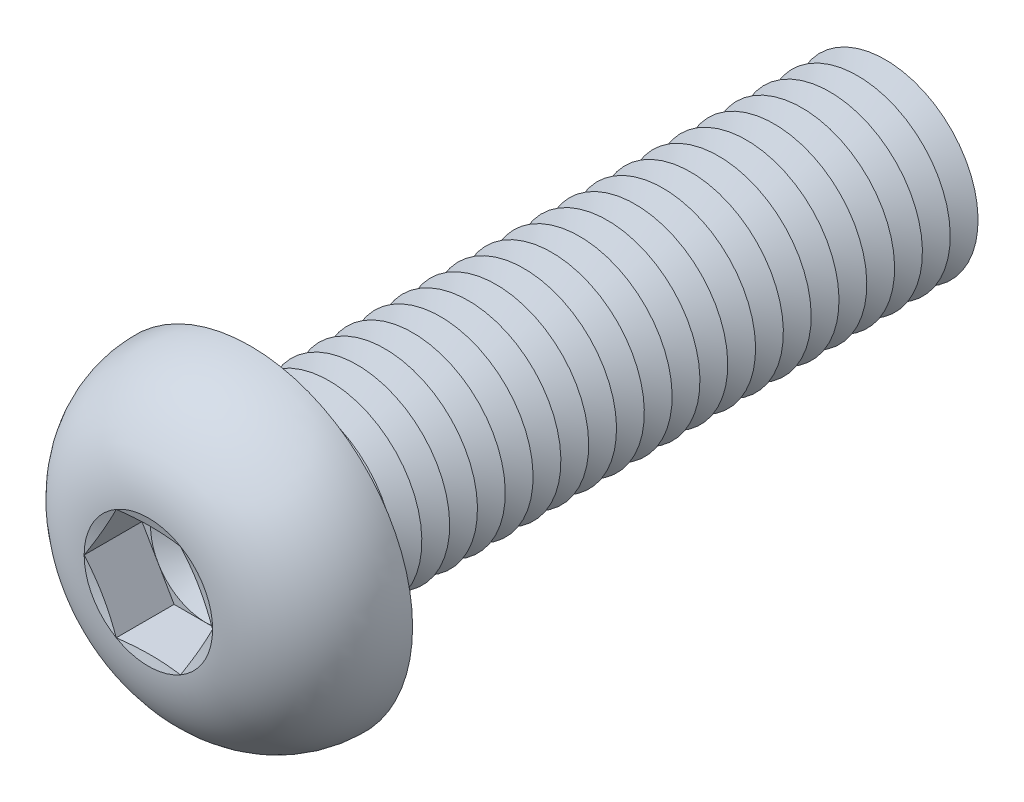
ISO-10303-21;
HEADER;
FILE_DESCRIPTION(('STEP AP214'),'2;1');
FILE_NAME('part.step','',(''),(''),'','','');
FILE_SCHEMA(('AUTOMOTIVE_DESIGN { 1 0 10303 214 1 1 1 1 }'));
ENDSEC;
DATA;
#1=APPLICATION_CONTEXT('core data for automotive mechanical design processes');
#2=APPLICATION_PROTOCOL_DEFINITION('international standard','automotive_design',2000,#1);
#3=PRODUCT_CONTEXT('',#1,'mechanical');
#4=PRODUCT('Part','Part','',(#3));
#5=PRODUCT_RELATED_PRODUCT_CATEGORY('part','',(#4));
#6=PRODUCT_DEFINITION_FORMATION('','',#4);
#7=PRODUCT_DEFINITION_CONTEXT('part definition',#1,'design');
#8=PRODUCT_DEFINITION('design','',#6,#7);
#9=PRODUCT_DEFINITION_SHAPE('','',#8);
#10=(LENGTH_UNIT() NAMED_UNIT(*) SI_UNIT(.MILLI.,.METRE.));
#11=(NAMED_UNIT(*) PLANE_ANGLE_UNIT() SI_UNIT($,.RADIAN.));
#12=(NAMED_UNIT(*) SI_UNIT($,.STERADIAN.) SOLID_ANGLE_UNIT());
#13=UNCERTAINTY_MEASURE_WITH_UNIT(LENGTH_MEASURE(1.E-05),#10,'distance_accuracy_value','');
#14=(GEOMETRIC_REPRESENTATION_CONTEXT(3) GLOBAL_UNCERTAINTY_ASSIGNED_CONTEXT((#13)) GLOBAL_UNIT_ASSIGNED_CONTEXT((#10,
#11,#12)) REPRESENTATION_CONTEXT('',''));
#15=CARTESIAN_POINT('',(0.,0.,0.));
#16=DIRECTION('',(0.,0.,1.));
#17=DIRECTION('',(1.,0.,0.));
#18=AXIS2_PLACEMENT_3D('',#15,#16,#17);
#19=CARTESIAN_POINT('',(0.,0.,2.38));
#20=DIRECTION('',(0.,0.,1.));
#21=DIRECTION('',(1.,0.,0.));
#22=AXIS2_PLACEMENT_3D('',#19,#20,#21);
#23=PLANE('',#22);
#24=CARTESIAN_POINT('',(0.,0.,2.38));
#25=DIRECTION('',(0.,0.,1.));
#26=DIRECTION('',(1.,0.,0.));
#27=AXIS2_PLACEMENT_3D('',#24,#25,#26);
#28=CIRCLE('',#27,2.99999860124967);
#29=CARTESIAN_POINT('',(2.598075,1.49999930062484,2.38));
#30=VERTEX_POINT('',#29);
#31=CARTESIAN_POINT('',(0.,2.99999860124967,2.38));
#32=VERTEX_POINT('',#31);
#33=EDGE_CURVE('E118',#30,#32,#28,.T.);
#34=ORIENTED_EDGE('',*,*,#33,.F.);
#35=DIRECTION('',(-0.500000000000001,0.866025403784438,0.));
#36=VECTOR('',#35,1.);
#37=CARTESIAN_POINT('',(3.4641,0.,2.38));
#38=LINE('',#37,#36);
#39=CARTESIAN_POINT('',(1.73205,2.99999860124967,2.38));
#40=VERTEX_POINT('',#39);
#41=EDGE_CURVE('E125',#30,#40,#38,.T.);
#42=ORIENTED_EDGE('',*,*,#41,.T.);
#43=DIRECTION('',(-1.,0.,0.));
#44=VECTOR('',#43,1.);
#45=CARTESIAN_POINT('',(1.73205,2.99999860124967,2.38));
#46=LINE('',#45,#44);
#47=EDGE_CURVE('E136',#40,#32,#46,.T.);
#48=ORIENTED_EDGE('',*,*,#47,.T.);
#49=EDGE_LOOP('',(#34,#42,#48));
#50=FACE_BOUND('',#49,.T.);
#51=ADVANCED_FACE('F39',(#50),#23,.T.);
#52=CARTESIAN_POINT('',(0.,0.,2.38));
#53=DIRECTION('',(0.,0.,1.));
#54=DIRECTION('',(1.,0.,0.));
#55=AXIS2_PLACEMENT_3D('',#52,#53,#54);
#56=CIRCLE('',#55,2.99999860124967);
#57=CARTESIAN_POINT('',(-2.598075,1.49999930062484,2.38));
#58=VERTEX_POINT('',#57);
#59=EDGE_CURVE('E11',#32,#58,#56,.T.);
#60=ORIENTED_EDGE('',*,*,#59,.F.);
#61=CARTESIAN_POINT('',(-1.73205,2.99999860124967,2.38));
#62=VERTEX_POINT('',#61);
#63=EDGE_CURVE('E131',#32,#62,#46,.T.);
#64=ORIENTED_EDGE('',*,*,#63,.T.);
#65=DIRECTION('',(-0.5,-0.866025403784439,0.));
#66=VECTOR('',#65,1.);
#67=CARTESIAN_POINT('',(-1.73205,2.99999860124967,2.38));
#68=LINE('',#67,#66);
#69=EDGE_CURVE('E134',#62,#58,#68,.T.);
#70=ORIENTED_EDGE('',*,*,#69,.T.);
#71=EDGE_LOOP('',(#60,#64,#70));
#72=FACE_BOUND('',#71,.T.);
#73=ADVANCED_FACE('F130',(#72),#23,.T.);
#74=CARTESIAN_POINT('',(-2.598075,-1.49999930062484,2.38));
#75=VERTEX_POINT('',#74);
#76=EDGE_CURVE('E49',#58,#75,#56,.T.);
#77=ORIENTED_EDGE('',*,*,#76,.F.);
#78=CARTESIAN_POINT('',(-3.4641,0.,2.38));
#79=VERTEX_POINT('',#78);
#80=EDGE_CURVE('E143',#58,#79,#68,.T.);
#81=ORIENTED_EDGE('',*,*,#80,.T.);
#82=DIRECTION('',(0.5,-0.866025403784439,0.));
#83=VECTOR('',#82,1.);
#84=CARTESIAN_POINT('',(-3.4641,0.,2.38));
#85=LINE('',#84,#83);
#86=EDGE_CURVE('E151',#79,#75,#85,.T.);
#87=ORIENTED_EDGE('',*,*,#86,.T.);
#88=EDGE_LOOP('',(#77,#81,#87));
#89=FACE_BOUND('',#88,.T.);
#90=ADVANCED_FACE('F411',(#89),#23,.T.);
#91=CARTESIAN_POINT('',(0.,-2.99999860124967,2.38));
#92=VERTEX_POINT('',#91);
#93=EDGE_CURVE('E397',#75,#92,#56,.T.);
#94=ORIENTED_EDGE('',*,*,#93,.F.);
#95=CARTESIAN_POINT('',(-1.73205,-2.99999860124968,2.38));
#96=VERTEX_POINT('',#95);
#97=EDGE_CURVE('E150',#75,#96,#85,.T.);
#98=ORIENTED_EDGE('',*,*,#97,.T.);
#99=DIRECTION('',(1.,0.,0.));
#100=VECTOR('',#99,1.);
#101=CARTESIAN_POINT('',(-1.73205,-2.99999860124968,2.38));
#102=LINE('',#101,#100);
#103=EDGE_CURVE('E156',#96,#92,#102,.T.);
#104=ORIENTED_EDGE('',*,*,#103,.T.);
#105=EDGE_LOOP('',(#94,#98,#104));
#106=FACE_BOUND('',#105,.T.);
#107=ADVANCED_FACE('F406',(#106),#23,.T.);
#108=CARTESIAN_POINT('',(2.598075,-1.49999930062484,2.38));
#109=VERTEX_POINT('',#108);
#110=EDGE_CURVE('E56',#92,#109,#56,.T.);
#111=ORIENTED_EDGE('',*,*,#110,.F.);
#112=CARTESIAN_POINT('',(1.73205,-2.99999860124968,2.38));
#113=VERTEX_POINT('',#112);
#114=EDGE_CURVE('E155',#92,#113,#102,.T.);
#115=ORIENTED_EDGE('',*,*,#114,.T.);
#116=DIRECTION('',(0.5,0.866025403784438,0.));
#117=VECTOR('',#116,1.);
#118=CARTESIAN_POINT('',(1.73205,-2.99999860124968,2.38));
#119=LINE('',#118,#117);
#120=EDGE_CURVE('E161',#113,#109,#119,.T.);
#121=ORIENTED_EDGE('',*,*,#120,.T.);
#122=EDGE_LOOP('',(#111,#115,#121));
#123=FACE_BOUND('',#122,.T.);
#124=ADVANCED_FACE('F528',(#123),#23,.T.);
#125=CARTESIAN_POINT('',(0.,0.,5.5));
#126=DIRECTION('',(0.,0.,1.));
#127=DIRECTION('',(0.,-1.,0.));
#128=AXIS2_PLACEMENT_3D('',#125,#126,#127);
#129=CONICAL_SURFACE('',#128,3.4641,1.30899693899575);
#130=CARTESIAN_POINT('',(3.46421547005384,-0.000200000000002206,5.50003094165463));
#131=CARTESIAN_POINT('',(3.39227822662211,0.124398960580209,5.48074619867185));
#132=CARTESIAN_POINT('',(3.32021054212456,0.249223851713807,5.46323875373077));
#133=CARTESIAN_POINT('',(3.17582062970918,0.499314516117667,5.43247971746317));
#134=CARTESIAN_POINT('',(3.10349831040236,0.624580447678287,5.41922985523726));
#135=CARTESIAN_POINT('',(2.95903767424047,0.874793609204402,5.39775958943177));
#136=CARTESIAN_POINT('',(2.88690033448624,0.999739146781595,5.38951357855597));
#137=CARTESIAN_POINT('',(2.74253364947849,1.2497895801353,5.37845651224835));
#138=CARTESIAN_POINT('',(2.67030432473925,1.37489444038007,5.37564440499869));
#139=CARTESIAN_POINT('',(2.52584567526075,1.6251041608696,5.37564440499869));
#140=CARTESIAN_POINT('',(2.45361635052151,1.75020902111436,5.37845651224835));
#141=CARTESIAN_POINT('',(2.30924966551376,2.00025945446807,5.38951357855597));
#142=CARTESIAN_POINT('',(2.23711232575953,2.12520499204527,5.39775958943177));
#143=CARTESIAN_POINT('',(2.09265168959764,2.37541815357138,5.41922985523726));
#144=CARTESIAN_POINT('',(2.02032937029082,2.500684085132,5.43247971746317));
#145=CARTESIAN_POINT('',(1.87593945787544,2.75077474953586,5.46323875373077));
#146=CARTESIAN_POINT('',(1.80387177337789,2.87559964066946,5.48074619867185));
#147=CARTESIAN_POINT('',(1.73193452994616,3.00019860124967,5.50003094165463));
#148=B_SPLINE_CURVE_WITH_KNOTS('',3,(#130,#131,#132,#133,#134,#135,#136,#137,#138,#139,#140,
#141,#142,#143,#144,#145,#146,#147),.UNSPECIFIED.,.F.,.F.,(4,2,2,2,2,2,2,2,4),(0.,
0.435506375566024,0.871189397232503,1.3046235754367,1.7379738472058,2.1713241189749,
2.6047582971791,3.04044131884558,3.4759476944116),.UNSPECIFIED.);
#149=CARTESIAN_POINT('',(3.4641,0.,5.5));
#150=VERTEX_POINT('',#149);
#151=CARTESIAN_POINT('',(1.73204999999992,2.99999860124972,5.5));
#152=VERTEX_POINT('',#151);
#153=EDGE_CURVE('E228',#150,#152,#148,.T.);
#154=ORIENTED_EDGE('',*,*,#153,.F.);
#155=CARTESIAN_POINT('',(0.,0.,5.5));
#156=DIRECTION('',(0.,0.,-1.));
#157=DIRECTION('',(0.,1.,0.));
#158=AXIS2_PLACEMENT_3D('',#155,#156,#157);
#159=CIRCLE('',#158,3.4641);
#160=EDGE_CURVE('E306',#152,#150,#159,.T.);
#161=ORIENTED_EDGE('',*,*,#160,.F.);
#162=EDGE_LOOP('',(#154,#161));
#163=FACE_BOUND('',#162,.T.);
#164=ADVANCED_FACE('F427',(#163),#129,.F.);
#165=CARTESIAN_POINT('',(1.73193452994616,-3.00019860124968,5.50003094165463));
#166=CARTESIAN_POINT('',(1.80387177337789,-2.87559964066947,5.48074619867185));
#167=CARTESIAN_POINT('',(1.87593945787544,-2.75077474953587,5.46323875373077));
#168=CARTESIAN_POINT('',(2.02032937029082,-2.50068408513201,5.43247971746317));
#169=CARTESIAN_POINT('',(2.09265168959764,-2.37541815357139,5.41922985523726));
#170=CARTESIAN_POINT('',(2.23711232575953,-2.12520499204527,5.39775958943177));
#171=CARTESIAN_POINT('',(2.30924966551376,-2.00025945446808,5.38951357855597));
#172=CARTESIAN_POINT('',(2.45361635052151,-1.75020902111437,5.37845651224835));
#173=CARTESIAN_POINT('',(2.52584567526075,-1.6251041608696,5.37564440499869));
#174=CARTESIAN_POINT('',(2.67030432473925,-1.37489444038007,5.37564440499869));
#175=CARTESIAN_POINT('',(2.74253364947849,-1.24978958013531,5.37845651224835));
#176=CARTESIAN_POINT('',(2.88690033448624,-0.999739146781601,5.38951357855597));
#177=CARTESIAN_POINT('',(2.95903767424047,-0.874793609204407,5.39775958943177));
#178=CARTESIAN_POINT('',(3.10349831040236,-0.624580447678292,5.41922985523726));
#179=CARTESIAN_POINT('',(3.17582062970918,-0.499314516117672,5.43247971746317));
#180=CARTESIAN_POINT('',(3.32021054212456,-0.249223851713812,5.46323875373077));
#181=CARTESIAN_POINT('',(3.39227822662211,-0.124398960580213,5.48074619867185));
#182=CARTESIAN_POINT('',(3.46421547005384,0.000199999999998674,5.50003094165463));
#183=B_SPLINE_CURVE_WITH_KNOTS('',3,(#165,#166,#167,#168,#169,#170,#171,#172,#173,#174,#175,
#176,#177,#178,#179,#180,#181,#182),.UNSPECIFIED.,.F.,.F.,(4,2,2,2,2,2,2,2,4),(0.,
0.435506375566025,0.871189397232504,1.3046235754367,1.7379738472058,2.1713241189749,
2.6047582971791,3.04044131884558,3.4759476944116),.UNSPECIFIED.);
#184=CARTESIAN_POINT('',(1.73205,-2.99999860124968,5.5));
#185=VERTEX_POINT('',#184);
#186=EDGE_CURVE('E231',#185,#150,#183,.T.);
#187=ORIENTED_EDGE('',*,*,#186,.F.);
#188=EDGE_CURVE('E290',#150,#185,#159,.T.);
#189=ORIENTED_EDGE('',*,*,#188,.F.);
#190=EDGE_LOOP('',(#187,#189));
#191=FACE_BOUND('',#190,.T.);
#192=ADVANCED_FACE('F288',(#191),#129,.F.);
#193=CARTESIAN_POINT('',(-5.2273006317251,-2.99999860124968,6.18672552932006));
#194=CARTESIAN_POINT('',(-5.10075887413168,-2.99999860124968,6.1573201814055));
#195=CARTESIAN_POINT('',(-4.97415993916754,-2.99999860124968,6.12816064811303));
#196=CARTESIAN_POINT('',(-4.72082394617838,-2.99999860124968,6.07043857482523));
#197=CARTESIAN_POINT('',(-4.59408688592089,-2.99999860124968,6.04187604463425));
#198=CARTESIAN_POINT('',(-4.21358997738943,-2.99999860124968,5.95723252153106));
#199=CARTESIAN_POINT('',(-3.95959339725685,-2.99999860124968,5.90220706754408));
#200=CARTESIAN_POINT('',(-3.44835573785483,-2.99999860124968,5.79574115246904));
#201=CARTESIAN_POINT('',(-3.19110656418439,-2.99999860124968,5.744339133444));
#202=CARTESIAN_POINT('',(-2.67540790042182,-2.99999860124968,5.64772994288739));
#203=CARTESIAN_POINT('',(-2.41695830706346,-2.99999860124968,5.60252331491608));
#204=CARTESIAN_POINT('',(-1.9055512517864,-2.99999860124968,5.52251897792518));
#205=CARTESIAN_POINT('',(-1.65263426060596,-2.99999860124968,5.48747285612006));
#206=CARTESIAN_POINT('',(-1.27220564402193,-2.99999860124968,5.44439602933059));
#207=CARTESIAN_POINT('',(-1.1452320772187,-2.99999860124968,5.43161987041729));
#208=CARTESIAN_POINT('',(-0.890973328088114,-2.99999860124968,5.40972605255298));
#209=CARTESIAN_POINT('',(-0.763688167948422,-2.99999860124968,5.40060814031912));
#210=CARTESIAN_POINT('',(-0.509442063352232,-2.99999860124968,5.38647457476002));
#211=CARTESIAN_POINT('',(-0.382482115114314,-2.99999860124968,5.38144125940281));
#212=CARTESIAN_POINT('',(-0.128463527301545,-2.99999860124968,5.37566637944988));
#213=CARTESIAN_POINT('',(-0.0014048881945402,-2.99999860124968,5.37492479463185));
#214=CARTESIAN_POINT('',(0.252672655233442,-2.99999860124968,5.37777315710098));
#215=CARTESIAN_POINT('',(0.379691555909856,-2.99999860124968,5.38136342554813));
#216=CARTESIAN_POINT('',(0.633540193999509,-2.99999860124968,5.39268816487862));
#217=CARTESIAN_POINT('',(0.76036993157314,-2.99999860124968,5.40042263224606));
#218=CARTESIAN_POINT('',(1.06836981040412,-2.99999860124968,5.42382465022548));
#219=CARTESIAN_POINT('',(1.24938929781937,-2.99999860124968,5.4414748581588));
#220=CARTESIAN_POINT('',(1.61066786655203,-2.99999860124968,5.48312309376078));
#221=CARTESIAN_POINT('',(1.7909269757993,-2.99999860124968,5.50712088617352));
#222=CARTESIAN_POINT('',(2.15127612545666,-2.99999860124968,5.56013471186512));
#223=CARTESIAN_POINT('',(2.33136383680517,-2.99999860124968,5.58916634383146));
#224=CARTESIAN_POINT('',(2.690892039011,-2.99999860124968,5.65100028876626));
#225=CARTESIAN_POINT('',(2.87033249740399,-2.99999860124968,5.6838027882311));
#226=CARTESIAN_POINT('',(3.23235399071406,-2.99999860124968,5.75295369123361));
#227=CARTESIAN_POINT('',(3.4149236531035,-2.99999860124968,5.78936117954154));
#228=CARTESIAN_POINT('',(3.77960351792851,-2.99999860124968,5.86440648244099));
#229=CARTESIAN_POINT('',(3.96171371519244,-2.99999860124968,5.903044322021));
#230=CARTESIAN_POINT('',(4.32457472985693,-2.99999860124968,5.98179660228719));
#231=CARTESIAN_POINT('',(4.5053275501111,-2.99999860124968,6.02190185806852));
#232=CARTESIAN_POINT('',(4.86652484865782,-2.99999860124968,6.10342152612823));
#233=CARTESIAN_POINT('',(5.04696934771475,-2.99999860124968,6.14483584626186));
#234=CARTESIAN_POINT('',(5.2273006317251,-2.99999860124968,6.18672552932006));
#235=B_SPLINE_CURVE_WITH_KNOTS('',3,(#193,#194,#195,#196,#197,#198,#199,#200,#201,#202,#203,
#204,#205,#206,#207,#208,#209,#210,#211,#212,#213,#214,#215,#216,#217,#218,#219,#220,#221,#222,
#223,#224,#225,#226,#227,#228,#229,#230,#231,#232,#233,#234),.UNSPECIFIED.,.F.,.F.,(4,2,2,2,2,2,
2,2,2,2,2,2,2,2,2,2,2,2,2,2,4),(0.,0.389739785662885,0.779485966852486,1.5591292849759,
2.34608117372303,3.13310206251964,3.8988410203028,4.28164148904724,4.66441544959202,
5.04552531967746,5.42663339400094,5.80776972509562,6.18890573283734,6.73438998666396,
7.27985402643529,7.8270395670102,8.37425218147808,8.93272720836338,9.49120849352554,
10.0466490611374,10.6020506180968),.UNSPECIFIED.);
#236=CARTESIAN_POINT('',(-1.73205,-2.99999860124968,5.5));
#237=VERTEX_POINT('',#236);
#238=EDGE_CURVE('E240',#237,#185,#235,.T.);
#239=ORIENTED_EDGE('',*,*,#238,.F.);
#240=EDGE_CURVE('E295',#185,#237,#159,.T.);
#241=ORIENTED_EDGE('',*,*,#240,.F.);
#242=EDGE_LOOP('',(#239,#241));
#243=FACE_BOUND('',#242,.T.);
#244=ADVANCED_FACE('F296',(#243),#129,.F.);
#245=CARTESIAN_POINT('',(-3.46421547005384,0.000199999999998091,5.50003094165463));
#246=CARTESIAN_POINT('',(-3.39227822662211,-0.124398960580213,5.48074619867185));
#247=CARTESIAN_POINT('',(-3.32021054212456,-0.249223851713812,5.46323875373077));
#248=CARTESIAN_POINT('',(-3.17582062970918,-0.499314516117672,5.43247971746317));
#249=CARTESIAN_POINT('',(-3.10349831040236,-0.624580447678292,5.41922985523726));
#250=CARTESIAN_POINT('',(-2.95903767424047,-0.874793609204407,5.39775958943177));
#251=CARTESIAN_POINT('',(-2.88690033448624,-0.999739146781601,5.38951357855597));
#252=CARTESIAN_POINT('',(-2.74253364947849,-1.24978958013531,5.37845651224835));
#253=CARTESIAN_POINT('',(-2.67030432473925,-1.37489444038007,5.37564440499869));
#254=CARTESIAN_POINT('',(-2.52584567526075,-1.6251041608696,5.37564440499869));
#255=CARTESIAN_POINT('',(-2.45361635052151,-1.75020902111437,5.37845651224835));
#256=CARTESIAN_POINT('',(-2.30924966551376,-2.00025945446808,5.38951357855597));
#257=CARTESIAN_POINT('',(-2.23711232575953,-2.12520499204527,5.39775958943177));
#258=CARTESIAN_POINT('',(-2.09265168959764,-2.37541815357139,5.41922985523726));
#259=CARTESIAN_POINT('',(-2.02032937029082,-2.50068408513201,5.43247971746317));
#260=CARTESIAN_POINT('',(-1.87593945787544,-2.75077474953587,5.46323875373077));
#261=CARTESIAN_POINT('',(-1.80387177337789,-2.87559964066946,5.48074619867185));
#262=CARTESIAN_POINT('',(-1.73193452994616,-3.00019860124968,5.50003094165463));
#263=B_SPLINE_CURVE_WITH_KNOTS('',3,(#245,#246,#247,#248,#249,#250,#251,#252,#253,#254,#255,
#256,#257,#258,#259,#260,#261,#262),.UNSPECIFIED.,.F.,.F.,(4,2,2,2,2,2,2,2,4),(0.,
0.435506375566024,0.871189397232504,1.3046235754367,1.7379738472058,2.1713241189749,
2.6047582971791,3.04044131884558,3.4759476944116),.UNSPECIFIED.);
#264=CARTESIAN_POINT('',(-3.4641,0.,5.5));
#265=VERTEX_POINT('',#264);
#266=EDGE_CURVE('E236',#265,#237,#263,.T.);
#267=ORIENTED_EDGE('',*,*,#266,.F.);
#268=EDGE_CURVE('E300',#237,#265,#159,.T.);
#269=ORIENTED_EDGE('',*,*,#268,.F.);
#270=EDGE_LOOP('',(#267,#269));
#271=FACE_BOUND('',#270,.T.);
#272=ADVANCED_FACE('F418',(#271),#129,.F.);
#273=CARTESIAN_POINT('',(-1.73193452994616,3.00019860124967,5.50003094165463));
#274=CARTESIAN_POINT('',(-1.8038717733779,2.87559964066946,5.48074619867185));
#275=CARTESIAN_POINT('',(-1.87593945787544,2.75077474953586,5.46323875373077));
#276=CARTESIAN_POINT('',(-2.02032937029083,2.500684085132,5.43247971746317));
#277=CARTESIAN_POINT('',(-2.09265168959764,2.37541815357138,5.41922985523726));
#278=CARTESIAN_POINT('',(-2.23711232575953,2.12520499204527,5.39775958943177));
#279=CARTESIAN_POINT('',(-2.30924966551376,2.00025945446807,5.38951357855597));
#280=CARTESIAN_POINT('',(-2.45361635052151,1.75020902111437,5.37845651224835));
#281=CARTESIAN_POINT('',(-2.52584567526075,1.6251041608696,5.37564440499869));
#282=CARTESIAN_POINT('',(-2.67030432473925,1.37489444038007,5.37564440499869));
#283=CARTESIAN_POINT('',(-2.74253364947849,1.2497895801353,5.37845651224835));
#284=CARTESIAN_POINT('',(-2.88690033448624,0.999739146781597,5.38951357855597));
#285=CARTESIAN_POINT('',(-2.95903767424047,0.874793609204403,5.39775958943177));
#286=CARTESIAN_POINT('',(-3.10349831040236,0.624580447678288,5.41922985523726));
#287=CARTESIAN_POINT('',(-3.17582062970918,0.499314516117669,5.43247971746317));
#288=CARTESIAN_POINT('',(-3.32021054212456,0.249223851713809,5.46323875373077));
#289=CARTESIAN_POINT('',(-3.39227822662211,0.12439896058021,5.48074619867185));
#290=CARTESIAN_POINT('',(-3.46421547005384,-0.000200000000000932,5.50003094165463));
#291=B_SPLINE_CURVE_WITH_KNOTS('',3,(#273,#274,#275,#276,#277,#278,#279,#280,#281,#282,#283,
#284,#285,#286,#287,#288,#289,#290),.UNSPECIFIED.,.F.,.F.,(4,2,2,2,2,2,2,2,4),(0.,
0.435506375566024,0.871189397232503,1.3046235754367,1.7379738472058,2.1713241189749,
2.6047582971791,3.04044131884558,3.4759476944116),.UNSPECIFIED.);
#292=CARTESIAN_POINT('',(-1.73205,2.99999860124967,5.5));
#293=VERTEX_POINT('',#292);
#294=EDGE_CURVE('E233',#293,#265,#291,.T.);
#295=ORIENTED_EDGE('',*,*,#294,.F.);
#296=EDGE_CURVE('E319',#265,#293,#159,.T.);
#297=ORIENTED_EDGE('',*,*,#296,.F.);
#298=EDGE_LOOP('',(#295,#297));
#299=FACE_BOUND('',#298,.T.);
#300=ADVANCED_FACE('F421',(#299),#129,.F.);
#301=CARTESIAN_POINT('',(0.,0.,-29.75));
#302=DIRECTION('',(0.,0.,1.));
#303=DIRECTION('',(0.,-1.,0.));
#304=AXIS2_PLACEMENT_3D('',#301,#302,#303);
#305=CONICAL_SURFACE('',#304,4.99999999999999,1.0471975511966);
#306=CARTESIAN_POINT('',(0.,0.,-30.5));
#307=DIRECTION('',(0.,0.,1.));
#308=DIRECTION('',(0.,-1.,0.));
#309=AXIS2_PLACEMENT_3D('',#306,#307,#308);
#310=CIRCLE('',#309,3.70096189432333);
#311=CARTESIAN_POINT('',(0.,-3.70096189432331,-30.5));
#312=VERTEX_POINT('',#311);
#313=EDGE_CURVE('E357',#312,#312,#310,.T.);
#314=ORIENTED_EDGE('',*,*,#313,.T.);
#315=EDGE_LOOP('',(#314));
#316=FACE_BOUND('',#315,.T.);
#317=CARTESIAN_POINT('',(0.,0.,-29.75));
#318=DIRECTION('',(0.,0.,1.));
#319=DIRECTION('',(0.,-1.,0.));
#320=AXIS2_PLACEMENT_3D('',#317,#318,#319);
#321=CIRCLE('',#320,4.99999999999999);
#322=CARTESIAN_POINT('',(0.,-4.99999999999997,-29.75));
#323=VERTEX_POINT('',#322);
#324=EDGE_CURVE('E346',#323,#323,#321,.T.);
#325=ORIENTED_EDGE('',*,*,#324,.F.);
#326=EDGE_LOOP('',(#325));
#327=FACE_BOUND('',#326,.T.);
#328=ADVANCED_FACE('F1032',(#316,#327),#305,.T.);
#329=CARTESIAN_POINT('',(0.,0.,-30.5));
#330=DIRECTION('',(0.,0.,-1.));
#331=DIRECTION('',(0.,1.,0.));
#332=AXIS2_PLACEMENT_3D('',#329,#330,#331);
#333=CONICAL_SURFACE('',#332,3.70096189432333,1.0471975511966);
#334=CARTESIAN_POINT('',(0.,0.,-31.25));
#335=DIRECTION('',(0.,0.,1.));
#336=DIRECTION('',(0.,-1.,0.));
#337=AXIS2_PLACEMENT_3D('',#334,#335,#336);
#338=CIRCLE('',#337,4.99999999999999);
#339=CARTESIAN_POINT('',(0.,-4.99999999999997,-31.25));
#340=VERTEX_POINT('',#339);
#341=EDGE_CURVE('E361',#340,#340,#338,.T.);
#342=ORIENTED_EDGE('',*,*,#341,.T.);
#343=EDGE_LOOP('',(#342));
#344=FACE_BOUND('',#343,.T.);
#345=ORIENTED_EDGE('',*,*,#313,.F.);
#346=EDGE_LOOP('',(#345));
#347=FACE_BOUND('',#346,.T.);
#348=ADVANCED_FACE('F1201',(#344,#347),#333,.T.);
#349=CARTESIAN_POINT('',(0.,5.,-35.));
#350=DIRECTION('',(0.,0.,-1.));
#351=DIRECTION('',(0.,1.,0.));
#352=AXIS2_PLACEMENT_3D('',#349,#350,#351);
#353=PLANE('',#352);
#354=CARTESIAN_POINT('',(0.,0.,-35.));
#355=DIRECTION('',(0.,0.,1.));
#356=DIRECTION('',(0.,-1.,0.));
#357=AXIS2_PLACEMENT_3D('',#354,#355,#356);
#358=CIRCLE('',#357,3.70096189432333);
#359=CARTESIAN_POINT('',(0.,-3.70096189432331,-35.));
#360=VERTEX_POINT('',#359);
#361=EDGE_CURVE('E326',#360,#360,#358,.T.);
#362=ORIENTED_EDGE('',*,*,#361,.F.);
#363=EDGE_LOOP('',(#362));
#364=FACE_BOUND('',#363,.T.);
#365=ADVANCED_FACE('F1206',(#364),#353,.T.);
#366=CARTESIAN_POINT('',(0.,0.,-34.25));
#367=DIRECTION('',(0.,0.,1.));
#368=DIRECTION('',(0.,-1.,0.));
#369=AXIS2_PLACEMENT_3D('',#366,#367,#368);
#370=CONICAL_SURFACE('',#369,4.99999999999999,1.0471975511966);
#371=ORIENTED_EDGE('',*,*,#361,.T.);
#372=EDGE_LOOP('',(#371));
#373=FACE_BOUND('',#372,.T.);
#374=CARTESIAN_POINT('',(0.,0.,-34.25));
#375=DIRECTION('',(0.,0.,1.));
#376=DIRECTION('',(0.,-1.,0.));
#377=AXIS2_PLACEMENT_3D('',#374,#375,#376);
#378=CIRCLE('',#377,4.99999999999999);
#379=CARTESIAN_POINT('',(0.,-4.99999999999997,-34.25));
#380=VERTEX_POINT('',#379);
#381=EDGE_CURVE('E376',#380,#380,#378,.T.);
#382=ORIENTED_EDGE('',*,*,#381,.F.);
#383=EDGE_LOOP('',(#382));
#384=FACE_BOUND('',#383,.T.);
#385=ADVANCED_FACE('F1195',(#373,#384),#370,.T.);
#386=CARTESIAN_POINT('',(0.,0.,-33.5));
#387=DIRECTION('',(0.,0.,-1.));
#388=DIRECTION('',(0.,1.,0.));
#389=AXIS2_PLACEMENT_3D('',#386,#387,#388);
#390=CONICAL_SURFACE('',#389,3.70096189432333,1.0471975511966);
#391=ORIENTED_EDGE('',*,*,#381,.T.);
#392=EDGE_LOOP('',(#391));
#393=FACE_BOUND('',#392,.T.);
#394=CARTESIAN_POINT('',(0.,0.,-33.5));
#395=DIRECTION('',(0.,0.,1.));
#396=DIRECTION('',(0.,-1.,0.));
#397=AXIS2_PLACEMENT_3D('',#394,#395,#396);
#398=CIRCLE('',#397,3.70096189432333);
#399=CARTESIAN_POINT('',(0.,-3.70096189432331,-33.5));
#400=VERTEX_POINT('',#399);
#401=EDGE_CURVE('E373',#400,#400,#398,.T.);
#402=ORIENTED_EDGE('',*,*,#401,.F.);
#403=EDGE_LOOP('',(#402));
#404=FACE_BOUND('',#403,.T.);
#405=ADVANCED_FACE('F1185',(#393,#404),#390,.T.);
#406=CARTESIAN_POINT('',(0.,0.,-32.75));
#407=DIRECTION('',(0.,0.,1.));
#408=DIRECTION('',(0.,-1.,0.));
#409=AXIS2_PLACEMENT_3D('',#406,#407,#408);
#410=CONICAL_SURFACE('',#409,4.99999999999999,1.0471975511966);
#411=ORIENTED_EDGE('',*,*,#401,.T.);
#412=EDGE_LOOP('',(#411));
#413=FACE_BOUND('',#412,.T.);
#414=CARTESIAN_POINT('',(0.,0.,-32.75));
#415=DIRECTION('',(0.,0.,1.));
#416=DIRECTION('',(0.,-1.,0.));
#417=AXIS2_PLACEMENT_3D('',#414,#415,#416);
#418=CIRCLE('',#417,4.99999999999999);
#419=CARTESIAN_POINT('',(0.,-4.99999999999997,-32.75));
#420=VERTEX_POINT('',#419);
#421=EDGE_CURVE('E369',#420,#420,#418,.T.);
#422=ORIENTED_EDGE('',*,*,#421,.F.);
#423=EDGE_LOOP('',(#422));
#424=FACE_BOUND('',#423,.T.);
#425=ADVANCED_FACE('F1175',(#413,#424),#410,.T.);
#426=CARTESIAN_POINT('',(0.,0.,-32.));
#427=DIRECTION('',(0.,0.,-1.));
#428=DIRECTION('',(0.,1.,0.));
#429=AXIS2_PLACEMENT_3D('',#426,#427,#428);
#430=CONICAL_SURFACE('',#429,3.70096189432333,1.0471975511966);
#431=ORIENTED_EDGE('',*,*,#421,.T.);
#432=EDGE_LOOP('',(#431));
#433=FACE_BOUND('',#432,.T.);
#434=CARTESIAN_POINT('',(0.,0.,-32.));
#435=DIRECTION('',(0.,0.,1.));
#436=DIRECTION('',(0.,-1.,0.));
#437=AXIS2_PLACEMENT_3D('',#434,#435,#436);
#438=CIRCLE('',#437,3.70096189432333);
#439=CARTESIAN_POINT('',(0.,-3.70096189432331,-32.));
#440=VERTEX_POINT('',#439);
#441=EDGE_CURVE('E365',#440,#440,#438,.T.);
#442=ORIENTED_EDGE('',*,*,#441,.F.);
#443=EDGE_LOOP('',(#442));
#444=FACE_BOUND('',#443,.T.);
#445=ADVANCED_FACE('F1165',(#433,#444),#430,.T.);
#446=CARTESIAN_POINT('',(0.,0.,-31.25));
#447=DIRECTION('',(0.,0.,1.));
#448=DIRECTION('',(0.,-1.,0.));
#449=AXIS2_PLACEMENT_3D('',#446,#447,#448);
#450=CONICAL_SURFACE('',#449,4.99999999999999,1.0471975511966);
#451=ORIENTED_EDGE('',*,*,#441,.T.);
#452=EDGE_LOOP('',(#451));
#453=FACE_BOUND('',#452,.T.);
#454=ORIENTED_EDGE('',*,*,#341,.F.);
#455=EDGE_LOOP('',(#454));
#456=FACE_BOUND('',#455,.T.);
#457=ADVANCED_FACE('F1155',(#453,#456),#450,.T.);
#458=CARTESIAN_POINT('',(0.,0.,-28.25));
#459=DIRECTION('',(0.,0.,1.));
#460=DIRECTION('',(0.,-1.,0.));
#461=AXIS2_PLACEMENT_3D('',#458,#459,#460);
#462=CONICAL_SURFACE('',#461,4.99999999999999,1.0471975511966);
#463=CARTESIAN_POINT('',(0.,0.,-29.));
#464=DIRECTION('',(0.,0.,1.));
#465=DIRECTION('',(0.,-1.,0.));
#466=AXIS2_PLACEMENT_3D('',#463,#464,#465);
#467=CIRCLE('',#466,3.70096189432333);
#468=CARTESIAN_POINT('',(0.,-3.70096189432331,-29.));
#469=VERTEX_POINT('',#468);
#470=EDGE_CURVE('E339',#469,#469,#467,.T.);
#471=ORIENTED_EDGE('',*,*,#470,.T.);
#472=EDGE_LOOP('',(#471));
#473=FACE_BOUND('',#472,.T.);
#474=CARTESIAN_POINT('',(0.,0.,-28.25));
#475=DIRECTION('',(0.,0.,1.));
#476=DIRECTION('',(0.,-1.,0.));
#477=AXIS2_PLACEMENT_3D('',#474,#475,#476);
#478=CIRCLE('',#477,4.99999999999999);
#479=CARTESIAN_POINT('',(0.,-4.99999999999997,-28.25));
#480=VERTEX_POINT('',#479);
#481=EDGE_CURVE('E337',#480,#480,#478,.T.);
#482=ORIENTED_EDGE('',*,*,#481,.F.);
#483=EDGE_LOOP('',(#482));
#484=FACE_BOUND('',#483,.T.);
#485=ADVANCED_FACE('F519',(#473,#484),#462,.T.);
#486=CARTESIAN_POINT('',(0.,0.,-29.));
#487=DIRECTION('',(0.,0.,-1.));
#488=DIRECTION('',(0.,1.,0.));
#489=AXIS2_PLACEMENT_3D('',#486,#487,#488);
#490=CONICAL_SURFACE('',#489,3.70096189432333,1.0471975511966);
#491=ORIENTED_EDGE('',*,*,#324,.T.);
#492=EDGE_LOOP('',(#491));
#493=FACE_BOUND('',#492,.T.);
#494=ORIENTED_EDGE('',*,*,#470,.F.);
#495=EDGE_LOOP('',(#494));
#496=FACE_BOUND('',#495,.T.);
#497=ADVANCED_FACE('F510',(#493,#496),#490,.T.);
#498=CARTESIAN_POINT('',(0.,0.,-26.75));
#499=DIRECTION('',(0.,0.,1.));
#500=DIRECTION('',(0.,-1.,0.));
#501=AXIS2_PLACEMENT_3D('',#498,#499,#500);
#502=CONICAL_SURFACE('',#501,4.99999999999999,1.0471975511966);
#503=CARTESIAN_POINT('',(0.,0.,-27.5));
#504=DIRECTION('',(0.,0.,1.));
#505=DIRECTION('',(0.,-1.,0.));
#506=AXIS2_PLACEMENT_3D('',#503,#504,#505);
#507=CIRCLE('',#506,3.70096189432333);
#508=CARTESIAN_POINT('',(0.,-3.70096189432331,-27.5));
#509=VERTEX_POINT('',#508);
#510=EDGE_CURVE('E340',#509,#509,#507,.T.);
#511=ORIENTED_EDGE('',*,*,#510,.T.);
#512=EDGE_LOOP('',(#511));
#513=FACE_BOUND('',#512,.T.);
#514=CARTESIAN_POINT('',(0.,0.,-26.75));
#515=DIRECTION('',(0.,0.,1.));
#516=DIRECTION('',(0.,-1.,0.));
#517=AXIS2_PLACEMENT_3D('',#514,#515,#516);
#518=CIRCLE('',#517,4.99999999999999);
#519=CARTESIAN_POINT('',(0.,-4.99999999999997,-26.75));
#520=VERTEX_POINT('',#519);
#521=EDGE_CURVE('E350',#520,#520,#518,.T.);
#522=ORIENTED_EDGE('',*,*,#521,.F.);
#523=EDGE_LOOP('',(#522));
#524=FACE_BOUND('',#523,.T.);
#525=ADVANCED_FACE('F507',(#513,#524),#502,.T.);
#526=CARTESIAN_POINT('',(0.,0.,-27.5));
#527=DIRECTION('',(0.,0.,-1.));
#528=DIRECTION('',(0.,1.,0.));
#529=AXIS2_PLACEMENT_3D('',#526,#527,#528);
#530=CONICAL_SURFACE('',#529,3.70096189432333,1.0471975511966);
#531=ORIENTED_EDGE('',*,*,#481,.T.);
#532=EDGE_LOOP('',(#531));
#533=FACE_BOUND('',#532,.T.);
#534=ORIENTED_EDGE('',*,*,#510,.F.);
#535=EDGE_LOOP('',(#534));
#536=FACE_BOUND('',#535,.T.);
#537=ADVANCED_FACE('F509',(#533,#536),#530,.T.);
#538=CARTESIAN_POINT('',(0.,0.,-25.25));
#539=DIRECTION('',(0.,0.,1.));
#540=DIRECTION('',(0.,-1.,0.));
#541=AXIS2_PLACEMENT_3D('',#538,#539,#540);
#542=CONICAL_SURFACE('',#541,4.99999999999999,1.0471975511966);
#543=CARTESIAN_POINT('',(0.,0.,-26.));
#544=DIRECTION('',(0.,0.,1.));
#545=DIRECTION('',(0.,-1.,0.));
#546=AXIS2_PLACEMENT_3D('',#543,#544,#545);
#547=CIRCLE('',#546,3.70096189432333);
#548=CARTESIAN_POINT('',(0.,-3.70096189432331,-26.));
#549=VERTEX_POINT('',#548);
#550=EDGE_CURVE('E497',#549,#549,#547,.T.);
#551=ORIENTED_EDGE('',*,*,#550,.T.);
#552=EDGE_LOOP('',(#551));
#553=FACE_BOUND('',#552,.T.);
#554=CARTESIAN_POINT('',(0.,0.,-25.25));
#555=DIRECTION('',(0.,0.,1.));
#556=DIRECTION('',(0.,-1.,0.));
#557=AXIS2_PLACEMENT_3D('',#554,#555,#556);
#558=CIRCLE('',#557,4.99999999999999);
#559=CARTESIAN_POINT('',(0.,-4.99999999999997,-25.25));
#560=VERTEX_POINT('',#559);
#561=EDGE_CURVE('E493',#560,#560,#558,.T.);
#562=ORIENTED_EDGE('',*,*,#561,.F.);
#563=EDGE_LOOP('',(#562));
#564=FACE_BOUND('',#563,.T.);
#565=ADVANCED_FACE('F517',(#553,#564),#542,.T.);
#566=CARTESIAN_POINT('',(0.,0.,-26.));
#567=DIRECTION('',(0.,0.,-1.));
#568=DIRECTION('',(0.,1.,0.));
#569=AXIS2_PLACEMENT_3D('',#566,#567,#568);
#570=CONICAL_SURFACE('',#569,3.70096189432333,1.0471975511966);
#571=ORIENTED_EDGE('',*,*,#521,.T.);
#572=EDGE_LOOP('',(#571));
#573=FACE_BOUND('',#572,.T.);
#574=ORIENTED_EDGE('',*,*,#550,.F.);
#575=EDGE_LOOP('',(#574));
#576=FACE_BOUND('',#575,.T.);
#577=ADVANCED_FACE('F504',(#573,#576),#570,.T.);
#578=CARTESIAN_POINT('',(0.,0.,-23.75));
#579=DIRECTION('',(0.,0.,1.));
#580=DIRECTION('',(0.,-1.,0.));
#581=AXIS2_PLACEMENT_3D('',#578,#579,#580);
#582=CONICAL_SURFACE('',#581,4.99999999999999,1.0471975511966);
#583=CARTESIAN_POINT('',(0.,0.,-24.5));
#584=DIRECTION('',(0.,0.,1.));
#585=DIRECTION('',(0.,-1.,0.));
#586=AXIS2_PLACEMENT_3D('',#583,#584,#585);
#587=CIRCLE('',#586,3.70096189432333);
#588=CARTESIAN_POINT('',(0.,-3.70096189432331,-24.5));
#589=VERTEX_POINT('',#588);
#590=EDGE_CURVE('E490',#589,#589,#587,.T.);
#591=ORIENTED_EDGE('',*,*,#590,.T.);
#592=EDGE_LOOP('',(#591));
#593=FACE_BOUND('',#592,.T.);
#594=CARTESIAN_POINT('',(0.,0.,-23.75));
#595=DIRECTION('',(0.,0.,1.));
#596=DIRECTION('',(0.,-1.,0.));
#597=AXIS2_PLACEMENT_3D('',#594,#595,#596);
#598=CIRCLE('',#597,4.99999999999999);
#599=CARTESIAN_POINT('',(0.,-4.99999999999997,-23.75));
#600=VERTEX_POINT('',#599);
#601=EDGE_CURVE('E486',#600,#600,#598,.T.);
#602=ORIENTED_EDGE('',*,*,#601,.F.);
#603=EDGE_LOOP('',(#602));
#604=FACE_BOUND('',#603,.T.);
#605=ADVANCED_FACE('F647',(#593,#604),#582,.T.);
#606=CARTESIAN_POINT('',(0.,0.,-24.5));
#607=DIRECTION('',(0.,0.,-1.));
#608=DIRECTION('',(0.,1.,0.));
#609=AXIS2_PLACEMENT_3D('',#606,#607,#608);
#610=CONICAL_SURFACE('',#609,3.70096189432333,1.0471975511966);
#611=ORIENTED_EDGE('',*,*,#561,.T.);
#612=EDGE_LOOP('',(#611));
#613=FACE_BOUND('',#612,.T.);
#614=ORIENTED_EDGE('',*,*,#590,.F.);
#615=EDGE_LOOP('',(#614));
#616=FACE_BOUND('',#615,.T.);
#617=ADVANCED_FACE('F643',(#613,#616),#610,.T.);
#618=CARTESIAN_POINT('',(0.,0.,-22.25));
#619=DIRECTION('',(0.,0.,1.));
#620=DIRECTION('',(0.,-1.,0.));
#621=AXIS2_PLACEMENT_3D('',#618,#619,#620);
#622=CONICAL_SURFACE('',#621,4.99999999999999,1.0471975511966);
#623=CARTESIAN_POINT('',(0.,0.,-23.));
#624=DIRECTION('',(0.,0.,1.));
#625=DIRECTION('',(0.,-1.,0.));
#626=AXIS2_PLACEMENT_3D('',#623,#624,#625);
#627=CIRCLE('',#626,3.70096189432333);
#628=CARTESIAN_POINT('',(0.,-3.70096189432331,-23.));
#629=VERTEX_POINT('',#628);
#630=EDGE_CURVE('E482',#629,#629,#627,.T.);
#631=ORIENTED_EDGE('',*,*,#630,.T.);
#632=EDGE_LOOP('',(#631));
#633=FACE_BOUND('',#632,.T.);
#634=CARTESIAN_POINT('',(0.,0.,-22.25));
#635=DIRECTION('',(0.,0.,1.));
#636=DIRECTION('',(0.,-1.,0.));
#637=AXIS2_PLACEMENT_3D('',#634,#635,#636);
#638=CIRCLE('',#637,4.99999999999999);
#639=CARTESIAN_POINT('',(0.,-4.99999999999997,-22.25));
#640=VERTEX_POINT('',#639);
#641=EDGE_CURVE('E478',#640,#640,#638,.T.);
#642=ORIENTED_EDGE('',*,*,#641,.F.);
#643=EDGE_LOOP('',(#642));
#644=FACE_BOUND('',#643,.T.);
#645=ADVANCED_FACE('F639',(#633,#644),#622,.T.);
#646=CARTESIAN_POINT('',(0.,0.,-23.));
#647=DIRECTION('',(0.,0.,-1.));
#648=DIRECTION('',(0.,1.,0.));
#649=AXIS2_PLACEMENT_3D('',#646,#647,#648);
#650=CONICAL_SURFACE('',#649,3.70096189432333,1.0471975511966);
#651=ORIENTED_EDGE('',*,*,#601,.T.);
#652=EDGE_LOOP('',(#651));
#653=FACE_BOUND('',#652,.T.);
#654=ORIENTED_EDGE('',*,*,#630,.F.);
#655=EDGE_LOOP('',(#654));
#656=FACE_BOUND('',#655,.T.);
#657=ADVANCED_FACE('F635',(#653,#656),#650,.T.);
#658=CARTESIAN_POINT('',(0.,0.,-20.75));
#659=DIRECTION('',(0.,0.,1.));
#660=DIRECTION('',(0.,-1.,0.));
#661=AXIS2_PLACEMENT_3D('',#658,#659,#660);
#662=CONICAL_SURFACE('',#661,4.99999999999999,1.0471975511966);
#663=CARTESIAN_POINT('',(0.,0.,-21.5));
#664=DIRECTION('',(0.,0.,1.));
#665=DIRECTION('',(0.,-1.,0.));
#666=AXIS2_PLACEMENT_3D('',#663,#664,#665);
#667=CIRCLE('',#666,3.70096189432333);
#668=CARTESIAN_POINT('',(0.,-3.70096189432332,-21.5));
#669=VERTEX_POINT('',#668);
#670=EDGE_CURVE('E474',#669,#669,#667,.T.);
#671=ORIENTED_EDGE('',*,*,#670,.T.);
#672=EDGE_LOOP('',(#671));
#673=FACE_BOUND('',#672,.T.);
#674=CARTESIAN_POINT('',(0.,0.,-20.75));
#675=DIRECTION('',(0.,0.,1.));
#676=DIRECTION('',(0.,-1.,0.));
#677=AXIS2_PLACEMENT_3D('',#674,#675,#676);
#678=CIRCLE('',#677,4.99999999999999);
#679=CARTESIAN_POINT('',(0.,-4.99999999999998,-20.75));
#680=VERTEX_POINT('',#679);
#681=EDGE_CURVE('E470',#680,#680,#678,.T.);
#682=ORIENTED_EDGE('',*,*,#681,.F.);
#683=EDGE_LOOP('',(#682));
#684=FACE_BOUND('',#683,.T.);
#685=ADVANCED_FACE('F631',(#673,#684),#662,.T.);
#686=CARTESIAN_POINT('',(0.,0.,-21.5));
#687=DIRECTION('',(0.,0.,-1.));
#688=DIRECTION('',(0.,1.,0.));
#689=AXIS2_PLACEMENT_3D('',#686,#687,#688);
#690=CONICAL_SURFACE('',#689,3.70096189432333,1.0471975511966);
#691=ORIENTED_EDGE('',*,*,#641,.T.);
#692=EDGE_LOOP('',(#691));
#693=FACE_BOUND('',#692,.T.);
#694=ORIENTED_EDGE('',*,*,#670,.F.);
#695=EDGE_LOOP('',(#694));
#696=FACE_BOUND('',#695,.T.);
#697=ADVANCED_FACE('F627',(#693,#696),#690,.T.);
#698=CARTESIAN_POINT('',(0.,0.,-19.25));
#699=DIRECTION('',(0.,0.,1.));
#700=DIRECTION('',(0.,-1.,0.));
#701=AXIS2_PLACEMENT_3D('',#698,#699,#700);
#702=CONICAL_SURFACE('',#701,4.99999999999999,1.0471975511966);
#703=CARTESIAN_POINT('',(0.,0.,-20.));
#704=DIRECTION('',(0.,0.,1.));
#705=DIRECTION('',(0.,-1.,0.));
#706=AXIS2_PLACEMENT_3D('',#703,#704,#705);
#707=CIRCLE('',#706,3.70096189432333);
#708=CARTESIAN_POINT('',(0.,-3.70096189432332,-20.));
#709=VERTEX_POINT('',#708);
#710=EDGE_CURVE('E466',#709,#709,#707,.T.);
#711=ORIENTED_EDGE('',*,*,#710,.T.);
#712=EDGE_LOOP('',(#711));
#713=FACE_BOUND('',#712,.T.);
#714=CARTESIAN_POINT('',(0.,0.,-19.25));
#715=DIRECTION('',(0.,0.,1.));
#716=DIRECTION('',(0.,-1.,0.));
#717=AXIS2_PLACEMENT_3D('',#714,#715,#716);
#718=CIRCLE('',#717,4.99999999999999);
#719=CARTESIAN_POINT('',(0.,-4.99999999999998,-19.25));
#720=VERTEX_POINT('',#719);
#721=EDGE_CURVE('E462',#720,#720,#718,.T.);
#722=ORIENTED_EDGE('',*,*,#721,.F.);
#723=EDGE_LOOP('',(#722));
#724=FACE_BOUND('',#723,.T.);
#725=ADVANCED_FACE('F623',(#713,#724),#702,.T.);
#726=CARTESIAN_POINT('',(0.,0.,-20.));
#727=DIRECTION('',(0.,0.,-1.));
#728=DIRECTION('',(0.,1.,0.));
#729=AXIS2_PLACEMENT_3D('',#726,#727,#728);
#730=CONICAL_SURFACE('',#729,3.70096189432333,1.0471975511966);
#731=ORIENTED_EDGE('',*,*,#681,.T.);
#732=EDGE_LOOP('',(#731));
#733=FACE_BOUND('',#732,.T.);
#734=ORIENTED_EDGE('',*,*,#710,.F.);
#735=EDGE_LOOP('',(#734));
#736=FACE_BOUND('',#735,.T.);
#737=ADVANCED_FACE('F619',(#733,#736),#730,.T.);
#738=CARTESIAN_POINT('',(0.,0.,-17.75));
#739=DIRECTION('',(0.,0.,1.));
#740=DIRECTION('',(0.,-1.,0.));
#741=AXIS2_PLACEMENT_3D('',#738,#739,#740);
#742=CONICAL_SURFACE('',#741,4.99999999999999,1.0471975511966);
#743=CARTESIAN_POINT('',(0.,0.,-18.5));
#744=DIRECTION('',(0.,0.,1.));
#745=DIRECTION('',(0.,-1.,0.));
#746=AXIS2_PLACEMENT_3D('',#743,#744,#745);
#747=CIRCLE('',#746,3.70096189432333);
#748=CARTESIAN_POINT('',(0.,-3.70096189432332,-18.5));
#749=VERTEX_POINT('',#748);
#750=EDGE_CURVE('E458',#749,#749,#747,.T.);
#751=ORIENTED_EDGE('',*,*,#750,.T.);
#752=EDGE_LOOP('',(#751));
#753=FACE_BOUND('',#752,.T.);
#754=CARTESIAN_POINT('',(0.,0.,-17.75));
#755=DIRECTION('',(0.,0.,1.));
#756=DIRECTION('',(0.,-1.,0.));
#757=AXIS2_PLACEMENT_3D('',#754,#755,#756);
#758=CIRCLE('',#757,4.99999999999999);
#759=CARTESIAN_POINT('',(0.,-4.99999999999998,-17.75));
#760=VERTEX_POINT('',#759);
#761=EDGE_CURVE('E454',#760,#760,#758,.T.);
#762=ORIENTED_EDGE('',*,*,#761,.F.);
#763=EDGE_LOOP('',(#762));
#764=FACE_BOUND('',#763,.T.);
#765=ADVANCED_FACE('F615',(#753,#764),#742,.T.);
#766=CARTESIAN_POINT('',(0.,0.,-18.5));
#767=DIRECTION('',(0.,0.,-1.));
#768=DIRECTION('',(0.,1.,0.));
#769=AXIS2_PLACEMENT_3D('',#766,#767,#768);
#770=CONICAL_SURFACE('',#769,3.70096189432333,1.0471975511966);
#771=ORIENTED_EDGE('',*,*,#721,.T.);
#772=EDGE_LOOP('',(#771));
#773=FACE_BOUND('',#772,.T.);
#774=ORIENTED_EDGE('',*,*,#750,.F.);
#775=EDGE_LOOP('',(#774));
#776=FACE_BOUND('',#775,.T.);
#777=ADVANCED_FACE('F611',(#773,#776),#770,.T.);
#778=CARTESIAN_POINT('',(0.,0.,-16.25));
#779=DIRECTION('',(0.,0.,1.));
#780=DIRECTION('',(0.,-1.,0.));
#781=AXIS2_PLACEMENT_3D('',#778,#779,#780);
#782=CONICAL_SURFACE('',#781,4.99999999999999,1.0471975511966);
#783=CARTESIAN_POINT('',(0.,0.,-17.));
#784=DIRECTION('',(0.,0.,1.));
#785=DIRECTION('',(0.,-1.,0.));
#786=AXIS2_PLACEMENT_3D('',#783,#784,#785);
#787=CIRCLE('',#786,3.70096189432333);
#788=CARTESIAN_POINT('',(0.,-3.70096189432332,-17.));
#789=VERTEX_POINT('',#788);
#790=EDGE_CURVE('E445',#789,#789,#787,.T.);
#791=ORIENTED_EDGE('',*,*,#790,.T.);
#792=EDGE_LOOP('',(#791));
#793=FACE_BOUND('',#792,.T.);
#794=CARTESIAN_POINT('',(0.,0.,-16.25));
#795=DIRECTION('',(0.,0.,1.));
#796=DIRECTION('',(0.,-1.,0.));
#797=AXIS2_PLACEMENT_3D('',#794,#795,#796);
#798=CIRCLE('',#797,4.99999999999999);
#799=CARTESIAN_POINT('',(0.,-4.99999999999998,-16.25));
#800=VERTEX_POINT('',#799);
#801=EDGE_CURVE('E439',#800,#800,#798,.T.);
#802=ORIENTED_EDGE('',*,*,#801,.F.);
#803=EDGE_LOOP('',(#802));
#804=FACE_BOUND('',#803,.T.);
#805=ADVANCED_FACE('F607',(#793,#804),#782,.T.);
#806=CARTESIAN_POINT('',(0.,0.,-17.));
#807=DIRECTION('',(0.,0.,-1.));
#808=DIRECTION('',(0.,1.,0.));
#809=AXIS2_PLACEMENT_3D('',#806,#807,#808);
#810=CONICAL_SURFACE('',#809,3.70096189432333,1.0471975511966);
#811=ORIENTED_EDGE('',*,*,#761,.T.);
#812=EDGE_LOOP('',(#811));
#813=FACE_BOUND('',#812,.T.);
#814=ORIENTED_EDGE('',*,*,#790,.F.);
#815=EDGE_LOOP('',(#814));
#816=FACE_BOUND('',#815,.T.);
#817=ADVANCED_FACE('F604',(#813,#816),#810,.T.);
#818=CARTESIAN_POINT('',(0.,0.,-14.75));
#819=DIRECTION('',(0.,0.,1.));
#820=DIRECTION('',(0.,-1.,0.));
#821=AXIS2_PLACEMENT_3D('',#818,#819,#820);
#822=CONICAL_SURFACE('',#821,4.99999999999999,1.0471975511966);
#823=CARTESIAN_POINT('',(0.,0.,-15.5));
#824=DIRECTION('',(0.,0.,1.));
#825=DIRECTION('',(0.,-1.,0.));
#826=AXIS2_PLACEMENT_3D('',#823,#824,#825);
#827=CIRCLE('',#826,3.70096189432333);
#828=CARTESIAN_POINT('',(0.,-3.70096189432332,-15.5));
#829=VERTEX_POINT('',#828);
#830=EDGE_CURVE('E437',#829,#829,#827,.T.);
#831=ORIENTED_EDGE('',*,*,#830,.T.);
#832=EDGE_LOOP('',(#831));
#833=FACE_BOUND('',#832,.T.);
#834=CARTESIAN_POINT('',(0.,0.,-14.75));
#835=DIRECTION('',(0.,0.,1.));
#836=DIRECTION('',(0.,-1.,0.));
#837=AXIS2_PLACEMENT_3D('',#834,#835,#836);
#838=CIRCLE('',#837,4.99999999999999);
#839=CARTESIAN_POINT('',(0.,-4.99999999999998,-14.75));
#840=VERTEX_POINT('',#839);
#841=EDGE_CURVE('E334',#840,#840,#838,.T.);
#842=ORIENTED_EDGE('',*,*,#841,.F.);
#843=EDGE_LOOP('',(#842));
#844=FACE_BOUND('',#843,.T.);
#845=ADVANCED_FACE('F597',(#833,#844),#822,.T.);
#846=CARTESIAN_POINT('',(0.,0.,-15.5));
#847=DIRECTION('',(0.,0.,-1.));
#848=DIRECTION('',(0.,1.,0.));
#849=AXIS2_PLACEMENT_3D('',#846,#847,#848);
#850=CONICAL_SURFACE('',#849,3.70096189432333,1.0471975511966);
#851=ORIENTED_EDGE('',*,*,#801,.T.);
#852=EDGE_LOOP('',(#851));
#853=FACE_BOUND('',#852,.T.);
#854=ORIENTED_EDGE('',*,*,#830,.F.);
#855=EDGE_LOOP('',(#854));
#856=FACE_BOUND('',#855,.T.);
#857=ADVANCED_FACE('F587',(#853,#856),#850,.T.);
#858=CARTESIAN_POINT('',(0.,0.,-13.25));
#859=DIRECTION('',(0.,0.,1.));
#860=DIRECTION('',(0.,-1.,0.));
#861=AXIS2_PLACEMENT_3D('',#858,#859,#860);
#862=CONICAL_SURFACE('',#861,4.99999999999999,1.0471975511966);
#863=CARTESIAN_POINT('',(0.,0.,-14.));
#864=DIRECTION('',(0.,0.,1.));
#865=DIRECTION('',(0.,-1.,0.));
#866=AXIS2_PLACEMENT_3D('',#863,#864,#865);
#867=CIRCLE('',#866,3.70096189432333);
#868=CARTESIAN_POINT('',(0.,-3.70096189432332,-14.));
#869=VERTEX_POINT('',#868);
#870=EDGE_CURVE('E331',#869,#869,#867,.T.);
#871=ORIENTED_EDGE('',*,*,#870,.T.);
#872=EDGE_LOOP('',(#871));
#873=FACE_BOUND('',#872,.T.);
#874=CARTESIAN_POINT('',(0.,0.,-13.25));
#875=DIRECTION('',(0.,0.,1.));
#876=DIRECTION('',(0.,-1.,0.));
#877=AXIS2_PLACEMENT_3D('',#874,#875,#876);
#878=CIRCLE('',#877,4.99999999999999);
#879=CARTESIAN_POINT('',(0.,-4.99999999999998,-13.25));
#880=VERTEX_POINT('',#879);
#881=EDGE_CURVE('E335',#880,#880,#878,.T.);
#882=ORIENTED_EDGE('',*,*,#881,.F.);
#883=EDGE_LOOP('',(#882));
#884=FACE_BOUND('',#883,.T.);
#885=ADVANCED_FACE('F584',(#873,#884),#862,.T.);
#886=CARTESIAN_POINT('',(0.,0.,-14.));
#887=DIRECTION('',(0.,0.,-1.));
#888=DIRECTION('',(0.,1.,0.));
#889=AXIS2_PLACEMENT_3D('',#886,#887,#888);
#890=CONICAL_SURFACE('',#889,3.70096189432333,1.0471975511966);
#891=ORIENTED_EDGE('',*,*,#841,.T.);
#892=EDGE_LOOP('',(#891));
#893=FACE_BOUND('',#892,.T.);
#894=ORIENTED_EDGE('',*,*,#870,.F.);
#895=EDGE_LOOP('',(#894));
#896=FACE_BOUND('',#895,.T.);
#897=ADVANCED_FACE('F586',(#893,#896),#890,.T.);
#898=CARTESIAN_POINT('',(0.,0.,-11.75));
#899=DIRECTION('',(0.,0.,1.));
#900=DIRECTION('',(0.,-1.,0.));
#901=AXIS2_PLACEMENT_3D('',#898,#899,#900);
#902=CONICAL_SURFACE('',#901,4.99999999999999,1.0471975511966);
#903=CARTESIAN_POINT('',(0.,0.,-12.5));
#904=DIRECTION('',(0.,0.,1.));
#905=DIRECTION('',(0.,-1.,0.));
#906=AXIS2_PLACEMENT_3D('',#903,#904,#905);
#907=CIRCLE('',#906,3.70096189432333);
#908=CARTESIAN_POINT('',(0.,-3.70096189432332,-12.5));
#909=VERTEX_POINT('',#908);
#910=EDGE_CURVE('E544',#909,#909,#907,.T.);
#911=ORIENTED_EDGE('',*,*,#910,.T.);
#912=EDGE_LOOP('',(#911));
#913=FACE_BOUND('',#912,.T.);
#914=CARTESIAN_POINT('',(0.,0.,-11.75));
#915=DIRECTION('',(0.,0.,1.));
#916=DIRECTION('',(0.,-1.,0.));
#917=AXIS2_PLACEMENT_3D('',#914,#915,#916);
#918=CIRCLE('',#917,4.99999999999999);
#919=CARTESIAN_POINT('',(0.,-4.99999999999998,-11.75));
#920=VERTEX_POINT('',#919);
#921=EDGE_CURVE('E546',#920,#920,#918,.T.);
#922=ORIENTED_EDGE('',*,*,#921,.F.);
#923=EDGE_LOOP('',(#922));
#924=FACE_BOUND('',#923,.T.);
#925=ADVANCED_FACE('F594',(#913,#924),#902,.T.);
#926=CARTESIAN_POINT('',(0.,0.,-12.5));
#927=DIRECTION('',(0.,0.,-1.));
#928=DIRECTION('',(0.,1.,0.));
#929=AXIS2_PLACEMENT_3D('',#926,#927,#928);
#930=CONICAL_SURFACE('',#929,3.70096189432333,1.0471975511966);
#931=ORIENTED_EDGE('',*,*,#881,.T.);
#932=EDGE_LOOP('',(#931));
#933=FACE_BOUND('',#932,.T.);
#934=ORIENTED_EDGE('',*,*,#910,.F.);
#935=EDGE_LOOP('',(#934));
#936=FACE_BOUND('',#935,.T.);
#937=ADVANCED_FACE('F581',(#933,#936),#930,.T.);
#938=CARTESIAN_POINT('',(0.,0.,-10.25));
#939=DIRECTION('',(0.,0.,1.));
#940=DIRECTION('',(0.,-1.,0.));
#941=AXIS2_PLACEMENT_3D('',#938,#939,#940);
#942=CONICAL_SURFACE('',#941,4.99999999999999,1.0471975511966);
#943=CARTESIAN_POINT('',(0.,0.,-11.));
#944=DIRECTION('',(0.,0.,1.));
#945=DIRECTION('',(0.,-1.,0.));
#946=AXIS2_PLACEMENT_3D('',#943,#944,#945);
#947=CIRCLE('',#946,3.70096189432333);
#948=CARTESIAN_POINT('',(0.,-3.70096189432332,-11.));
#949=VERTEX_POINT('',#948);
#950=EDGE_CURVE('E434',#949,#949,#947,.T.);
#951=ORIENTED_EDGE('',*,*,#950,.T.);
#952=EDGE_LOOP('',(#951));
#953=FACE_BOUND('',#952,.T.);
#954=CARTESIAN_POINT('',(0.,0.,-10.25));
#955=DIRECTION('',(0.,0.,1.));
#956=DIRECTION('',(0.,-1.,0.));
#957=AXIS2_PLACEMENT_3D('',#954,#955,#956);
#958=CIRCLE('',#957,4.99999999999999);
#959=CARTESIAN_POINT('',(0.,-4.99999999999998,-10.25));
#960=VERTEX_POINT('',#959);
#961=EDGE_CURVE('E431',#960,#960,#958,.T.);
#962=ORIENTED_EDGE('',*,*,#961,.F.);
#963=EDGE_LOOP('',(#962));
#964=FACE_BOUND('',#963,.T.);
#965=ADVANCED_FACE('F755',(#953,#964),#942,.T.);
#966=CARTESIAN_POINT('',(0.,0.,-11.));
#967=DIRECTION('',(0.,0.,-1.));
#968=DIRECTION('',(0.,1.,0.));
#969=AXIS2_PLACEMENT_3D('',#966,#967,#968);
#970=CONICAL_SURFACE('',#969,3.70096189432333,1.0471975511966);
#971=ORIENTED_EDGE('',*,*,#921,.T.);
#972=EDGE_LOOP('',(#971));
#973=FACE_BOUND('',#972,.T.);
#974=ORIENTED_EDGE('',*,*,#950,.F.);
#975=EDGE_LOOP('',(#974));
#976=FACE_BOUND('',#975,.T.);
#977=ADVANCED_FACE('F763',(#973,#976),#970,.T.);
#978=CARTESIAN_POINT('',(0.,0.,-8.74999999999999));
#979=DIRECTION('',(0.,0.,1.));
#980=DIRECTION('',(0.,-1.,0.));
#981=AXIS2_PLACEMENT_3D('',#978,#979,#980);
#982=CONICAL_SURFACE('',#981,4.99999999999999,1.0471975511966);
#983=CARTESIAN_POINT('',(0.,0.,-9.49999999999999));
#984=DIRECTION('',(0.,0.,1.));
#985=DIRECTION('',(0.,-1.,0.));
#986=AXIS2_PLACEMENT_3D('',#983,#984,#985);
#987=CIRCLE('',#986,3.70096189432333);
#988=CARTESIAN_POINT('',(0.,-3.70096189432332,-9.49999999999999));
#989=VERTEX_POINT('',#988);
#990=EDGE_CURVE('E435',#989,#989,#987,.T.);
#991=ORIENTED_EDGE('',*,*,#990,.T.);
#992=EDGE_LOOP('',(#991));
#993=FACE_BOUND('',#992,.T.);
#994=CARTESIAN_POINT('',(0.,0.,-8.74999999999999));
#995=DIRECTION('',(0.,0.,1.));
#996=DIRECTION('',(0.,-1.,0.));
#997=AXIS2_PLACEMENT_3D('',#994,#995,#996);
#998=CIRCLE('',#997,4.99999999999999);
#999=CARTESIAN_POINT('',(0.,-4.99999999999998,-8.74999999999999));
#1000=VERTEX_POINT('',#999);
#1001=EDGE_CURVE('E550',#1000,#1000,#998,.T.);
#1002=ORIENTED_EDGE('',*,*,#1001,.F.);
#1003=EDGE_LOOP('',(#1002));
#1004=FACE_BOUND('',#1003,.T.);
#1005=ADVANCED_FACE('F772',(#993,#1004),#982,.T.);
#1006=CARTESIAN_POINT('',(0.,0.,-9.49999999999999));
#1007=DIRECTION('',(0.,0.,-1.));
#1008=DIRECTION('',(0.,1.,0.));
#1009=AXIS2_PLACEMENT_3D('',#1006,#1007,#1008);
#1010=CONICAL_SURFACE('',#1009,3.70096189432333,1.0471975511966);
#1011=ORIENTED_EDGE('',*,*,#961,.T.);
#1012=EDGE_LOOP('',(#1011));
#1013=FACE_BOUND('',#1012,.T.);
#1014=ORIENTED_EDGE('',*,*,#990,.F.);
#1015=EDGE_LOOP('',(#1014));
#1016=FACE_BOUND('',#1015,.T.);
#1017=ADVANCED_FACE('F781',(#1013,#1016),#1010,.T.);
#1018=CARTESIAN_POINT('',(0.,0.,-7.24999999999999));
#1019=DIRECTION('',(0.,0.,1.));
#1020=DIRECTION('',(0.,-1.,0.));
#1021=AXIS2_PLACEMENT_3D('',#1018,#1019,#1020);
#1022=CONICAL_SURFACE('',#1021,4.99999999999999,1.0471975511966);
#1023=CARTESIAN_POINT('',(0.,0.,-7.99999999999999));
#1024=DIRECTION('',(0.,0.,1.));
#1025=DIRECTION('',(0.,-1.,0.));
#1026=AXIS2_PLACEMENT_3D('',#1023,#1024,#1025);
#1027=CIRCLE('',#1026,3.70096189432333);
#1028=CARTESIAN_POINT('',(0.,-3.70096189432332,-7.99999999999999));
#1029=VERTEX_POINT('',#1028);
#1030=EDGE_CURVE('E560',#1029,#1029,#1027,.T.);
#1031=ORIENTED_EDGE('',*,*,#1030,.T.);
#1032=EDGE_LOOP('',(#1031));
#1033=FACE_BOUND('',#1032,.T.);
#1034=CARTESIAN_POINT('',(0.,0.,-7.24999999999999));
#1035=DIRECTION('',(0.,0.,1.));
#1036=DIRECTION('',(0.,-1.,0.));
#1037=AXIS2_PLACEMENT_3D('',#1034,#1035,#1036);
#1038=CIRCLE('',#1037,4.99999999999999);
#1039=CARTESIAN_POINT('',(0.,-4.99999999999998,-7.24999999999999));
#1040=VERTEX_POINT('',#1039);
#1041=EDGE_CURVE('E556',#1040,#1040,#1038,.T.);
#1042=ORIENTED_EDGE('',*,*,#1041,.F.);
#1043=EDGE_LOOP('',(#1042));
#1044=FACE_BOUND('',#1043,.T.);
#1045=ADVANCED_FACE('F790',(#1033,#1044),#1022,.T.);
#1046=CARTESIAN_POINT('',(0.,0.,-7.99999999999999));
#1047=DIRECTION('',(0.,0.,-1.));
#1048=DIRECTION('',(0.,1.,0.));
#1049=AXIS2_PLACEMENT_3D('',#1046,#1047,#1048);
#1050=CONICAL_SURFACE('',#1049,3.70096189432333,1.0471975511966);
#1051=ORIENTED_EDGE('',*,*,#1001,.T.);
#1052=EDGE_LOOP('',(#1051));
#1053=FACE_BOUND('',#1052,.T.);
#1054=ORIENTED_EDGE('',*,*,#1030,.F.);
#1055=EDGE_LOOP('',(#1054));
#1056=FACE_BOUND('',#1055,.T.);
#1057=ADVANCED_FACE('F799',(#1053,#1056),#1050,.T.);
#1058=CARTESIAN_POINT('',(0.,0.,-5.74999999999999));
#1059=DIRECTION('',(0.,0.,1.));
#1060=DIRECTION('',(0.,-1.,0.));
#1061=AXIS2_PLACEMENT_3D('',#1058,#1059,#1060);
#1062=CONICAL_SURFACE('',#1061,4.99999999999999,1.0471975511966);
#1063=CARTESIAN_POINT('',(0.,0.,-6.49999999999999));
#1064=DIRECTION('',(0.,0.,1.));
#1065=DIRECTION('',(0.,-1.,0.));
#1066=AXIS2_PLACEMENT_3D('',#1063,#1064,#1065);
#1067=CIRCLE('',#1066,3.70096189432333);
#1068=CARTESIAN_POINT('',(0.,-3.70096189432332,-6.49999999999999));
#1069=VERTEX_POINT('',#1068);
#1070=EDGE_CURVE('E553',#1069,#1069,#1067,.T.);
#1071=ORIENTED_EDGE('',*,*,#1070,.T.);
#1072=EDGE_LOOP('',(#1071));
#1073=FACE_BOUND('',#1072,.T.);
#1074=CARTESIAN_POINT('',(0.,0.,-5.74999999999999));
#1075=DIRECTION('',(0.,0.,1.));
#1076=DIRECTION('',(0.,-1.,0.));
#1077=AXIS2_PLACEMENT_3D('',#1074,#1075,#1076);
#1078=CIRCLE('',#1077,4.99999999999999);
#1079=CARTESIAN_POINT('',(0.,-4.99999999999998,-5.74999999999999));
#1080=VERTEX_POINT('',#1079);
#1081=EDGE_CURVE('E557',#1080,#1080,#1078,.T.);
#1082=ORIENTED_EDGE('',*,*,#1081,.F.);
#1083=EDGE_LOOP('',(#1082));
#1084=FACE_BOUND('',#1083,.T.);
#1085=ADVANCED_FACE('F808',(#1073,#1084),#1062,.T.);
#1086=CARTESIAN_POINT('',(0.,0.,-6.49999999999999));
#1087=DIRECTION('',(0.,0.,-1.));
#1088=DIRECTION('',(0.,1.,0.));
#1089=AXIS2_PLACEMENT_3D('',#1086,#1087,#1088);
#1090=CONICAL_SURFACE('',#1089,3.70096189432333,1.0471975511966);
#1091=ORIENTED_EDGE('',*,*,#1041,.T.);
#1092=EDGE_LOOP('',(#1091));
#1093=FACE_BOUND('',#1092,.T.);
#1094=ORIENTED_EDGE('',*,*,#1070,.F.);
#1095=EDGE_LOOP('',(#1094));
#1096=FACE_BOUND('',#1095,.T.);
#1097=ADVANCED_FACE('F817',(#1093,#1096),#1090,.T.);
#1098=CARTESIAN_POINT('',(0.,0.,-4.24999999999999));
#1099=DIRECTION('',(0.,0.,1.));
#1100=DIRECTION('',(0.,-1.,0.));
#1101=AXIS2_PLACEMENT_3D('',#1098,#1099,#1100);
#1102=CONICAL_SURFACE('',#1101,4.99999999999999,1.0471975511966);
#1103=CARTESIAN_POINT('',(0.,0.,-4.99999999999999));
#1104=DIRECTION('',(0.,0.,1.));
#1105=DIRECTION('',(0.,-1.,0.));
#1106=AXIS2_PLACEMENT_3D('',#1103,#1104,#1105);
#1107=CIRCLE('',#1106,3.70096189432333);
#1108=CARTESIAN_POINT('',(0.,-3.70096189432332,-4.99999999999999));
#1109=VERTEX_POINT('',#1108);
#1110=EDGE_CURVE('E1296',#1109,#1109,#1107,.T.);
#1111=ORIENTED_EDGE('',*,*,#1110,.T.);
#1112=EDGE_LOOP('',(#1111));
#1113=FACE_BOUND('',#1112,.T.);
#1114=CARTESIAN_POINT('',(0.,0.,-4.24999999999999));
#1115=DIRECTION('',(0.,0.,1.));
#1116=DIRECTION('',(0.,-1.,0.));
#1117=AXIS2_PLACEMENT_3D('',#1114,#1115,#1116);
#1118=CIRCLE('',#1117,4.99999999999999);
#1119=CARTESIAN_POINT('',(0.,-4.99999999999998,-4.24999999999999));
#1120=VERTEX_POINT('',#1119);
#1121=EDGE_CURVE('E1291',#1120,#1120,#1118,.T.);
#1122=ORIENTED_EDGE('',*,*,#1121,.F.);
#1123=EDGE_LOOP('',(#1122));
#1124=FACE_BOUND('',#1123,.T.);
#1125=ADVANCED_FACE('F826',(#1113,#1124),#1102,.T.);
#1126=CARTESIAN_POINT('',(0.,0.,-4.99999999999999));
#1127=DIRECTION('',(0.,0.,-1.));
#1128=DIRECTION('',(0.,1.,0.));
#1129=AXIS2_PLACEMENT_3D('',#1126,#1127,#1128);
#1130=CONICAL_SURFACE('',#1129,3.70096189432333,1.0471975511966);
#1131=ORIENTED_EDGE('',*,*,#1081,.T.);
#1132=EDGE_LOOP('',(#1131));
#1133=FACE_BOUND('',#1132,.T.);
#1134=ORIENTED_EDGE('',*,*,#1110,.F.);
#1135=EDGE_LOOP('',(#1134));
#1136=FACE_BOUND('',#1135,.T.);
#1137=ADVANCED_FACE('F834',(#1133,#1136),#1130,.T.);
#1138=CARTESIAN_POINT('',(0.,0.,-2.74999999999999));
#1139=DIRECTION('',(0.,0.,1.));
#1140=DIRECTION('',(0.,-1.,0.));
#1141=AXIS2_PLACEMENT_3D('',#1138,#1139,#1140);
#1142=CONICAL_SURFACE('',#1141,4.99999999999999,1.0471975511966);
#1143=CARTESIAN_POINT('',(0.,0.,-3.49999999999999));
#1144=DIRECTION('',(0.,0.,1.));
#1145=DIRECTION('',(0.,-1.,0.));
#1146=AXIS2_PLACEMENT_3D('',#1143,#1144,#1145);
#1147=CIRCLE('',#1146,3.70096189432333);
#1148=CARTESIAN_POINT('',(0.,-3.70096189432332,-3.49999999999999));
#1149=VERTEX_POINT('',#1148);
#1150=EDGE_CURVE('E1287',#1149,#1149,#1147,.T.);
#1151=ORIENTED_EDGE('',*,*,#1150,.T.);
#1152=EDGE_LOOP('',(#1151));
#1153=FACE_BOUND('',#1152,.T.);
#1154=CARTESIAN_POINT('',(0.,0.,-2.74999999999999));
#1155=DIRECTION('',(0.,0.,1.));
#1156=DIRECTION('',(0.,-1.,0.));
#1157=AXIS2_PLACEMENT_3D('',#1154,#1155,#1156);
#1158=CIRCLE('',#1157,4.99999999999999);
#1159=CARTESIAN_POINT('',(0.,-4.99999999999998,-2.74999999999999));
#1160=VERTEX_POINT('',#1159);
#1161=EDGE_CURVE('E539',#1160,#1160,#1158,.T.);
#1162=ORIENTED_EDGE('',*,*,#1161,.F.);
#1163=EDGE_LOOP('',(#1162));
#1164=FACE_BOUND('',#1163,.T.);
#1165=ADVANCED_FACE('F843',(#1153,#1164),#1142,.T.);
#1166=CARTESIAN_POINT('',(0.,0.,-3.49999999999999));
#1167=DIRECTION('',(0.,0.,-1.));
#1168=DIRECTION('',(0.,1.,0.));
#1169=AXIS2_PLACEMENT_3D('',#1166,#1167,#1168);
#1170=CONICAL_SURFACE('',#1169,3.70096189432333,1.0471975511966);
#1171=ORIENTED_EDGE('',*,*,#1121,.T.);
#1172=EDGE_LOOP('',(#1171));
#1173=FACE_BOUND('',#1172,.T.);
#1174=ORIENTED_EDGE('',*,*,#1150,.F.);
#1175=EDGE_LOOP('',(#1174));
#1176=FACE_BOUND('',#1175,.T.);
#1177=ADVANCED_FACE('F852',(#1173,#1176),#1170,.T.);
#1178=CARTESIAN_POINT('',(0.,0.,-1.24999999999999));
#1179=DIRECTION('',(0.,0.,1.));
#1180=DIRECTION('',(0.,-1.,0.));
#1181=AXIS2_PLACEMENT_3D('',#1178,#1179,#1180);
#1182=CONICAL_SURFACE('',#1181,4.99999999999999,1.0471975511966);
#1183=CARTESIAN_POINT('',(0.,0.,-1.99999999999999));
#1184=DIRECTION('',(0.,0.,1.));
#1185=DIRECTION('',(0.,-1.,0.));
#1186=AXIS2_PLACEMENT_3D('',#1183,#1184,#1185);
#1187=CIRCLE('',#1186,3.70096189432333);
#1188=CARTESIAN_POINT('',(0.,-3.70096189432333,-1.99999999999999));
#1189=VERTEX_POINT('',#1188);
#1190=EDGE_CURVE('E225',#1189,#1189,#1187,.T.);
#1191=ORIENTED_EDGE('',*,*,#1190,.T.);
#1192=EDGE_LOOP('',(#1191));
#1193=FACE_BOUND('',#1192,.T.);
#1194=CARTESIAN_POINT('',(0.,0.,-1.24999999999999));
#1195=DIRECTION('',(0.,0.,1.));
#1196=DIRECTION('',(0.,-1.,0.));
#1197=AXIS2_PLACEMENT_3D('',#1194,#1195,#1196);
#1198=CIRCLE('',#1197,4.99999999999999);
#1199=CARTESIAN_POINT('',(0.,-4.99999999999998,-1.24999999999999));
#1200=VERTEX_POINT('',#1199);
#1201=EDGE_CURVE('E541',#1200,#1200,#1198,.T.);
#1202=ORIENTED_EDGE('',*,*,#1201,.F.);
#1203=EDGE_LOOP('',(#1202));
#1204=FACE_BOUND('',#1203,.T.);
#1205=ADVANCED_FACE('F861',(#1193,#1204),#1182,.T.);
#1206=CARTESIAN_POINT('',(0.,0.,-1.99999999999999));
#1207=DIRECTION('',(0.,0.,-1.));
#1208=DIRECTION('',(0.,1.,0.));
#1209=AXIS2_PLACEMENT_3D('',#1206,#1207,#1208);
#1210=CONICAL_SURFACE('',#1209,3.70096189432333,1.0471975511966);
#1211=ORIENTED_EDGE('',*,*,#1161,.T.);
#1212=EDGE_LOOP('',(#1211));
#1213=FACE_BOUND('',#1212,.T.);
#1214=ORIENTED_EDGE('',*,*,#1190,.F.);
#1215=EDGE_LOOP('',(#1214));
#1216=FACE_BOUND('',#1215,.T.);
#1217=ADVANCED_FACE('F209',(#1213,#1216),#1210,.T.);
#1218=CARTESIAN_POINT('',(5.2273006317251,2.99999860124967,6.18672552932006));
#1219=CARTESIAN_POINT('',(5.10075887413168,2.99999860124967,6.15732018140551));
#1220=CARTESIAN_POINT('',(4.97415993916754,2.99999860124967,6.12816064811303));
#1221=CARTESIAN_POINT('',(4.72082394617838,2.99999860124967,6.07043857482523));
#1222=CARTESIAN_POINT('',(4.59408688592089,2.99999860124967,6.04187604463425));
#1223=CARTESIAN_POINT('',(4.21358997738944,2.99999860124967,5.95723252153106));
#1224=CARTESIAN_POINT('',(3.95959339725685,2.99999860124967,5.90220706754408));
#1225=CARTESIAN_POINT('',(3.44835573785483,2.99999860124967,5.79574115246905));
#1226=CARTESIAN_POINT('',(3.19110656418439,2.99999860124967,5.744339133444));
#1227=CARTESIAN_POINT('',(2.67540790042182,2.99999860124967,5.6477299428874));
#1228=CARTESIAN_POINT('',(2.41695830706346,2.99999860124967,5.60252331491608));
#1229=CARTESIAN_POINT('',(1.9055512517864,2.99999860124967,5.52251897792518));
#1230=CARTESIAN_POINT('',(1.65263426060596,2.99999860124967,5.48747285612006));
#1231=CARTESIAN_POINT('',(1.27220564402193,2.99999860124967,5.44439602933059));
#1232=CARTESIAN_POINT('',(1.1452320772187,2.99999860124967,5.43161987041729));
#1233=CARTESIAN_POINT('',(0.890973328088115,2.99999860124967,5.40972605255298));
#1234=CARTESIAN_POINT('',(0.763688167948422,2.99999860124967,5.40060814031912));
#1235=CARTESIAN_POINT('',(0.509442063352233,2.99999860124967,5.38647457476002));
#1236=CARTESIAN_POINT('',(0.382482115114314,2.99999860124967,5.38144125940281));
#1237=CARTESIAN_POINT('',(0.128463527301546,2.99999860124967,5.37566637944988));
#1238=CARTESIAN_POINT('',(0.00140488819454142,2.99999860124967,5.37492479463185));
#1239=CARTESIAN_POINT('',(-0.252672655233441,2.99999860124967,5.37777315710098));
#1240=CARTESIAN_POINT('',(-0.379691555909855,2.99999860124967,5.38136342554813));
#1241=CARTESIAN_POINT('',(-0.633540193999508,2.99999860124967,5.39268816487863));
#1242=CARTESIAN_POINT('',(-0.760369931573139,2.99999860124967,5.40042263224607));
#1243=CARTESIAN_POINT('',(-1.06836981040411,2.99999860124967,5.42382465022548));
#1244=CARTESIAN_POINT('',(-1.24938929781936,2.99999860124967,5.4414748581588));
#1245=CARTESIAN_POINT('',(-1.61066786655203,2.99999860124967,5.48312309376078));
#1246=CARTESIAN_POINT('',(-1.7909269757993,2.99999860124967,5.50712088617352));
#1247=CARTESIAN_POINT('',(-2.15127612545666,2.99999860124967,5.56013471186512));
#1248=CARTESIAN_POINT('',(-2.33136383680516,2.99999860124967,5.58916634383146));
#1249=CARTESIAN_POINT('',(-2.690892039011,2.99999860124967,5.65100028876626));
#1250=CARTESIAN_POINT('',(-2.87033249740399,2.99999860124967,5.68380278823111));
#1251=CARTESIAN_POINT('',(-3.23235399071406,2.99999860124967,5.75295369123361));
#1252=CARTESIAN_POINT('',(-3.4149236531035,2.99999860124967,5.78936117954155));
#1253=CARTESIAN_POINT('',(-3.77960351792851,2.99999860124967,5.864406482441));
#1254=CARTESIAN_POINT('',(-3.96171371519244,2.99999860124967,5.903044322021));
#1255=CARTESIAN_POINT('',(-4.32457472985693,2.99999860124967,5.98179660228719));
#1256=CARTESIAN_POINT('',(-4.5053275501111,2.99999860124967,6.02190185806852));
#1257=CARTESIAN_POINT('',(-4.86652484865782,2.99999860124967,6.10342152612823));
#1258=CARTESIAN_POINT('',(-5.04696934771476,2.99999860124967,6.14483584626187));
#1259=CARTESIAN_POINT('',(-5.2273006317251,2.99999860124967,6.18672552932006));
#1260=B_SPLINE_CURVE_WITH_KNOTS('',3,(#1218,#1219,#1220,#1221,#1222,#1223,#1224,#1225,#1226,
#1227,#1228,#1229,#1230,#1231,#1232,#1233,#1234,#1235,#1236,#1237,#1238,#1239,#1240,#1241,#1242,
#1243,#1244,#1245,#1246,#1247,#1248,#1249,#1250,#1251,#1252,#1253,#1254,#1255,#1256,#1257,#1258,
#1259),.UNSPECIFIED.,.F.,.F.,(4,2,2,2,2,2,2,2,2,2,2,2,2,2,2,2,2,2,2,2,4),(0.,0.389739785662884,
0.779485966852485,1.5591292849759,2.34608117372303,3.13310206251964,3.8988410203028,
4.28164148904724,4.66441544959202,5.04552531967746,5.42663339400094,5.80776972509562,
6.18890573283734,6.73438998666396,7.27985402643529,7.8270395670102,8.37425218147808,
8.93272720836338,9.49120849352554,10.0466490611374,10.6020506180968),.UNSPECIFIED.);
#1261=EDGE_CURVE('E169',#152,#293,#1260,.T.);
#1262=ORIENTED_EDGE('',*,*,#1261,.F.);
#1263=EDGE_CURVE('E323',#293,#152,#159,.T.);
#1264=ORIENTED_EDGE('',*,*,#1263,.F.);
#1265=EDGE_LOOP('',(#1262,#1264));
#1266=FACE_BOUND('',#1265,.T.);
#1267=ADVANCED_FACE('F192',(#1266),#129,.F.);
#1268=CARTESIAN_POINT('',(0.,0.,0.));
#1269=DIRECTION('',(0.,0.,-1.));
#1270=DIRECTION('',(0.,1.,0.));
#1271=AXIS2_PLACEMENT_3D('',#1268,#1269,#1270);
#1272=DEGENERATE_TOROIDAL_SURFACE('',#1271,3.24566404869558,5.50433595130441,.T.);
#1273=ORIENTED_EDGE('',*,*,#160,.T.);
#1274=ORIENTED_EDGE('',*,*,#188,.T.);
#1275=ORIENTED_EDGE('',*,*,#240,.T.);
#1276=ORIENTED_EDGE('',*,*,#268,.T.);
#1277=ORIENTED_EDGE('',*,*,#296,.T.);
#1278=ORIENTED_EDGE('',*,*,#1263,.T.);
#1279=EDGE_LOOP('',(#1273,#1274,#1275,#1276,#1277,#1278));
#1280=FACE_BOUND('',#1279,.T.);
#1281=CARTESIAN_POINT('',(0.,0.,0.));
#1282=DIRECTION('',(0.,0.,-1.));
#1283=DIRECTION('',(0.,1.,0.));
#1284=AXIS2_PLACEMENT_3D('',#1281,#1282,#1283);
#1285=CIRCLE('',#1284,8.75);
#1286=CARTESIAN_POINT('',(0.,8.75,0.));
#1287=VERTEX_POINT('',#1286);
#1288=EDGE_CURVE('E312',#1287,#1287,#1285,.T.);
#1289=ORIENTED_EDGE('',*,*,#1288,.F.);
#1290=EDGE_LOOP('',(#1289));
#1291=FACE_BOUND('',#1290,.T.);
#1292=ADVANCED_FACE('F302',(#1280,#1291),#1272,.T.);
#1293=CARTESIAN_POINT('',(0.,5.,0.));
#1294=DIRECTION('',(0.,0.,-1.));
#1295=DIRECTION('',(0.,1.,0.));
#1296=AXIS2_PLACEMENT_3D('',#1293,#1294,#1295);
#1297=PLANE('',#1296);
#1298=CARTESIAN_POINT('',(0.,0.,0.));
#1299=DIRECTION('',(0.,0.,-1.));
#1300=DIRECTION('',(0.,1.,0.));
#1301=AXIS2_PLACEMENT_3D('',#1298,#1299,#1300);
#1302=CIRCLE('',#1301,5.74999999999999);
#1303=CARTESIAN_POINT('',(0.,5.74999999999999,0.));
#1304=VERTEX_POINT('',#1303);
#1305=EDGE_CURVE('E390',#1304,#1304,#1302,.F.);
#1306=ORIENTED_EDGE('',*,*,#1305,.T.);
#1307=EDGE_LOOP('',(#1306));
#1308=FACE_BOUND('',#1307,.T.);
#1309=ORIENTED_EDGE('',*,*,#1288,.T.);
#1310=EDGE_LOOP('',(#1309));
#1311=FACE_BOUND('',#1310,.T.);
#1312=ADVANCED_FACE('F892',(#1308,#1311),#1297,.T.);
#1313=CARTESIAN_POINT('',(0.,0.,-0.750000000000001));
#1314=DIRECTION('',(0.,0.,-1.));
#1315=DIRECTION('',(0.,1.,0.));
#1316=AXIS2_PLACEMENT_3D('',#1313,#1314,#1315);
#1317=TOROIDAL_SURFACE('',#1316,5.74999999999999,0.75);
#1318=ORIENTED_EDGE('',*,*,#1305,.F.);
#1319=EDGE_LOOP('',(#1318));
#1320=FACE_BOUND('',#1319,.T.);
#1321=CARTESIAN_POINT('',(0.,0.,-0.750000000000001));
#1322=DIRECTION('',(0.,0.,-1.));
#1323=DIRECTION('',(0.,1.,0.));
#1324=AXIS2_PLACEMENT_3D('',#1321,#1322,#1323);
#1325=CIRCLE('',#1324,4.99999999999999);
#1326=CARTESIAN_POINT('',(0.,4.99999999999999,-0.749999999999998));
#1327=VERTEX_POINT('',#1326);
#1328=EDGE_CURVE('E386',#1327,#1327,#1325,.T.);
#1329=ORIENTED_EDGE('',*,*,#1328,.F.);
#1330=EDGE_LOOP('',(#1329));
#1331=FACE_BOUND('',#1330,.T.);
#1332=ADVANCED_FACE('F41',(#1320,#1331),#1317,.F.);
#1333=CARTESIAN_POINT('',(0.,0.,-35.));
#1334=DIRECTION('',(0.,0.,-1.));
#1335=DIRECTION('',(0.,1.,0.));
#1336=AXIS2_PLACEMENT_3D('',#1333,#1334,#1335);
#1337=CYLINDRICAL_SURFACE('',#1336,4.99999999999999);
#1338=ORIENTED_EDGE('',*,*,#1328,.T.);
#1339=EDGE_LOOP('',(#1338));
#1340=FACE_BOUND('',#1339,.T.);
#1341=ORIENTED_EDGE('',*,*,#1201,.T.);
#1342=EDGE_LOOP('',(#1341));
#1343=FACE_BOUND('',#1342,.T.);
#1344=ADVANCED_FACE('F207',(#1340,#1343),#1337,.T.);
#1345=CARTESIAN_POINT('',(3.4641,0.,2.38));
#1346=DIRECTION('',(0.866025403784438,0.500000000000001,0.));
#1347=DIRECTION('',(-0.500000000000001,0.866025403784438,0.));
#1348=AXIS2_PLACEMENT_3D('',#1345,#1346,#1347);
#1349=PLANE('',#1348);
#1350=ORIENTED_EDGE('',*,*,#153,.T.);
#1351=DIRECTION('',(0.,0.,1.));
#1352=VECTOR('',#1351,1.);
#1353=CARTESIAN_POINT('',(1.73205,2.99999860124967,2.38));
#1354=LINE('',#1353,#1352);
#1355=EDGE_CURVE('E64',#40,#152,#1354,.T.);
#1356=ORIENTED_EDGE('',*,*,#1355,.F.);
#1357=ORIENTED_EDGE('',*,*,#41,.F.);
#1358=CARTESIAN_POINT('',(3.4641,0.,2.38));
#1359=VERTEX_POINT('',#1358);
#1360=EDGE_CURVE('E140',#1359,#30,#38,.T.);
#1361=ORIENTED_EDGE('',*,*,#1360,.F.);
#1362=DIRECTION('',(0.,0.,1.));
#1363=VECTOR('',#1362,1.);
#1364=CARTESIAN_POINT('',(3.4641,0.,2.38));
#1365=LINE('',#1364,#1363);
#1366=EDGE_CURVE('E165',#1359,#150,#1365,.T.);
#1367=ORIENTED_EDGE('',*,*,#1366,.T.);
#1368=EDGE_LOOP('',(#1350,#1356,#1357,#1361,#1367));
#1369=FACE_BOUND('',#1368,.T.);
#1370=ADVANCED_FACE('F202',(#1369),#1349,.F.);
#1371=CARTESIAN_POINT('',(1.73205,-2.99999860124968,2.38));
#1372=DIRECTION('',(0.866025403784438,-0.5,0.));
#1373=DIRECTION('',(0.5,0.866025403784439,0.));
#1374=AXIS2_PLACEMENT_3D('',#1371,#1372,#1373);
#1375=PLANE('',#1374);
#1376=ORIENTED_EDGE('',*,*,#186,.T.);
#1377=ORIENTED_EDGE('',*,*,#1366,.F.);
#1378=EDGE_CURVE('E160',#109,#1359,#119,.T.);
#1379=ORIENTED_EDGE('',*,*,#1378,.F.);
#1380=ORIENTED_EDGE('',*,*,#120,.F.);
#1381=DIRECTION('',(0.,0.,1.));
#1382=VECTOR('',#1381,1.);
#1383=CARTESIAN_POINT('',(1.73205,-2.99999860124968,2.38));
#1384=LINE('',#1383,#1382);
#1385=EDGE_CURVE('E170',#113,#185,#1384,.T.);
#1386=ORIENTED_EDGE('',*,*,#1385,.T.);
#1387=EDGE_LOOP('',(#1376,#1377,#1379,#1380,#1386));
#1388=FACE_BOUND('',#1387,.T.);
#1389=ADVANCED_FACE('F206',(#1388),#1375,.F.);
#1390=CARTESIAN_POINT('',(-1.73205,-2.99999860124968,2.38));
#1391=DIRECTION('',(0.,-1.,0.));
#1392=DIRECTION('',(0.,0.,-1.));
#1393=AXIS2_PLACEMENT_3D('',#1390,#1391,#1392);
#1394=PLANE('',#1393);
#1395=ORIENTED_EDGE('',*,*,#238,.T.);
#1396=ORIENTED_EDGE('',*,*,#1385,.F.);
#1397=ORIENTED_EDGE('',*,*,#114,.F.);
#1398=ORIENTED_EDGE('',*,*,#103,.F.);
#1399=DIRECTION('',(0.,0.,1.));
#1400=VECTOR('',#1399,1.);
#1401=CARTESIAN_POINT('',(-1.73205,-2.99999860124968,2.38));
#1402=LINE('',#1401,#1400);
#1403=EDGE_CURVE('E175',#96,#237,#1402,.T.);
#1404=ORIENTED_EDGE('',*,*,#1403,.T.);
#1405=EDGE_LOOP('',(#1395,#1396,#1397,#1398,#1404));
#1406=FACE_BOUND('',#1405,.T.);
#1407=ADVANCED_FACE('F250',(#1406),#1394,.F.);
#1408=CARTESIAN_POINT('',(-3.4641,0.,2.38));
#1409=DIRECTION('',(-0.866025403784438,-0.5,0.));
#1410=DIRECTION('',(0.5,-0.866025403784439,0.));
#1411=AXIS2_PLACEMENT_3D('',#1408,#1409,#1410);
#1412=PLANE('',#1411);
#1413=ORIENTED_EDGE('',*,*,#266,.T.);
#1414=ORIENTED_EDGE('',*,*,#1403,.F.);
#1415=ORIENTED_EDGE('',*,*,#97,.F.);
#1416=ORIENTED_EDGE('',*,*,#86,.F.);
#1417=DIRECTION('',(0.,0.,1.));
#1418=VECTOR('',#1417,1.);
#1419=CARTESIAN_POINT('',(-3.4641,0.,2.38));
#1420=LINE('',#1419,#1418);
#1421=EDGE_CURVE('E171',#79,#265,#1420,.T.);
#1422=ORIENTED_EDGE('',*,*,#1421,.T.);
#1423=EDGE_LOOP('',(#1413,#1414,#1415,#1416,#1422));
#1424=FACE_BOUND('',#1423,.T.);
#1425=ADVANCED_FACE('F253',(#1424),#1412,.F.);
#1426=CARTESIAN_POINT('',(-1.73205,2.99999860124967,2.38));
#1427=DIRECTION('',(-0.866025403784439,0.5,0.));
#1428=DIRECTION('',(-0.5,-0.866025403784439,0.));
#1429=AXIS2_PLACEMENT_3D('',#1426,#1427,#1428);
#1430=PLANE('',#1429);
#1431=ORIENTED_EDGE('',*,*,#294,.T.);
#1432=ORIENTED_EDGE('',*,*,#1421,.F.);
#1433=ORIENTED_EDGE('',*,*,#80,.F.);
#1434=ORIENTED_EDGE('',*,*,#69,.F.);
#1435=DIRECTION('',(0.,0.,1.));
#1436=VECTOR('',#1435,1.);
#1437=CARTESIAN_POINT('',(-1.73205,2.99999860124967,2.38));
#1438=LINE('',#1437,#1436);
#1439=EDGE_CURVE('E138',#62,#293,#1438,.T.);
#1440=ORIENTED_EDGE('',*,*,#1439,.T.);
#1441=EDGE_LOOP('',(#1431,#1432,#1433,#1434,#1440));
#1442=FACE_BOUND('',#1441,.T.);
#1443=ADVANCED_FACE('F199',(#1442),#1430,.F.);
#1444=CARTESIAN_POINT('',(1.73205,2.99999860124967,2.38));
#1445=DIRECTION('',(0.,1.,0.));
#1446=DIRECTION('',(-1.,0.,0.));
#1447=AXIS2_PLACEMENT_3D('',#1444,#1445,#1446);
#1448=PLANE('',#1447);
#1449=ORIENTED_EDGE('',*,*,#1261,.T.);
#1450=ORIENTED_EDGE('',*,*,#1439,.F.);
#1451=ORIENTED_EDGE('',*,*,#63,.F.);
#1452=ORIENTED_EDGE('',*,*,#47,.F.);
#1453=ORIENTED_EDGE('',*,*,#1355,.T.);
#1454=EDGE_LOOP('',(#1449,#1450,#1451,#1452,#1453));
#1455=FACE_BOUND('',#1454,.T.);
#1456=ADVANCED_FACE('F135',(#1455),#1448,.F.);
#1457=EDGE_CURVE('E43',#109,#30,#56,.T.);
#1458=ORIENTED_EDGE('',*,*,#1457,.F.);
#1459=ORIENTED_EDGE('',*,*,#1378,.T.);
#1460=ORIENTED_EDGE('',*,*,#1360,.T.);
#1461=EDGE_LOOP('',(#1458,#1459,#1460));
#1462=FACE_BOUND('',#1461,.T.);
#1463=ADVANCED_FACE('F115',(#1462),#23,.T.);
#1464=CARTESIAN_POINT('',(0.,0.,2.38));
#1465=DIRECTION('',(0.,0.,1.));
#1466=DIRECTION('',(1.,0.,0.));
#1467=AXIS2_PLACEMENT_3D('',#1464,#1465,#1466);
#1468=CONICAL_SURFACE('',#1467,2.99999860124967,1.0471975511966);
#1469=CARTESIAN_POINT('',(0.,0.,0.647950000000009));
#1470=VERTEX_POINT('',#1469);
#1471=VERTEX_LOOP('',#1470);
#1472=FACE_BOUND('',#1471,.T.);
#1473=ORIENTED_EDGE('',*,*,#33,.T.);
#1474=ORIENTED_EDGE('',*,*,#59,.T.);
#1475=ORIENTED_EDGE('',*,*,#76,.T.);
#1476=ORIENTED_EDGE('',*,*,#93,.T.);
#1477=ORIENTED_EDGE('',*,*,#110,.T.);
#1478=ORIENTED_EDGE('',*,*,#1457,.T.);
#1479=EDGE_LOOP('',(#1473,#1474,#1475,#1476,#1477,#1478));
#1480=FACE_BOUND('',#1479,.T.);
#1481=ADVANCED_FACE('F113',(#1472,#1480),#1468,.F.);
#1482=CLOSED_SHELL('',(#51,#73,#90,#107,#124,#164,#192,#244,#272,#300,#328,#348,#365,#385,#405,
#425,#445,#457,#485,#497,#525,#537,#565,#577,#605,#617,#645,#657,#685,#697,#725,#737,#765,#777,
#805,#817,#845,#857,#885,#897,#925,#937,#965,#977,#1005,#1017,#1045,#1057,#1085,#1097,#1125,
#1137,#1165,#1177,#1205,#1217,#1267,#1292,#1312,#1332,#1344,#1370,#1389,#1407,#1425,#1443,#1456,
#1463,#1481));
#1483=MANIFOLD_SOLID_BREP('B2',#1482);
#1484=ADVANCED_BREP_SHAPE_REPRESENTATION('',(#18,#1483),#14);
#1485=SHAPE_DEFINITION_REPRESENTATION(#9,#1484);
ENDSEC;
END-ISO-10303-21;
